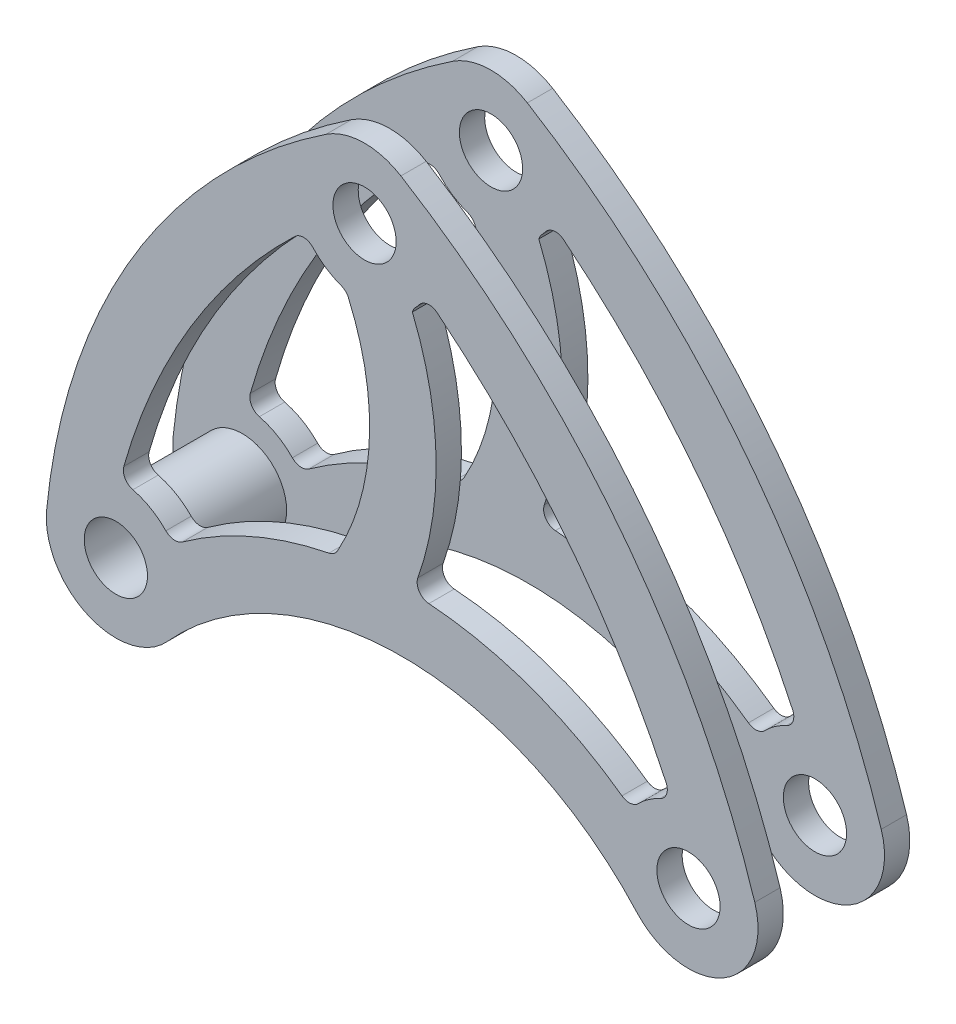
ISO-10303-21;
HEADER;
FILE_DESCRIPTION(('STEP AP214'),'2;1');
FILE_NAME('part.step','',(''),(''),'','','');
FILE_SCHEMA(('AUTOMOTIVE_DESIGN { 1 0 10303 214 1 1 1 1 }'));
ENDSEC;
DATA;
#1=APPLICATION_CONTEXT('core data for automotive mechanical design processes');
#2=APPLICATION_PROTOCOL_DEFINITION('international standard','automotive_design',2000,#1);
#3=PRODUCT_CONTEXT('',#1,'mechanical');
#4=PRODUCT('Part','Part','',(#3));
#5=PRODUCT_RELATED_PRODUCT_CATEGORY('part','',(#4));
#6=PRODUCT_DEFINITION_FORMATION('','',#4);
#7=PRODUCT_DEFINITION_CONTEXT('part definition',#1,'design');
#8=PRODUCT_DEFINITION('design','',#6,#7);
#9=PRODUCT_DEFINITION_SHAPE('','',#8);
#10=(LENGTH_UNIT() NAMED_UNIT(*) SI_UNIT(.MILLI.,.METRE.));
#11=(NAMED_UNIT(*) PLANE_ANGLE_UNIT() SI_UNIT($,.RADIAN.));
#12=(NAMED_UNIT(*) SI_UNIT($,.STERADIAN.) SOLID_ANGLE_UNIT());
#13=UNCERTAINTY_MEASURE_WITH_UNIT(LENGTH_MEASURE(1.E-05),#10,'distance_accuracy_value','');
#14=(GEOMETRIC_REPRESENTATION_CONTEXT(3) GLOBAL_UNCERTAINTY_ASSIGNED_CONTEXT((#13)) GLOBAL_UNIT_ASSIGNED_CONTEXT((#10,
#11,#12)) REPRESENTATION_CONTEXT('',''));
#15=CARTESIAN_POINT('',(0.,0.,0.));
#16=DIRECTION('',(0.,0.,1.));
#17=DIRECTION('',(1.,0.,0.));
#18=AXIS2_PLACEMENT_3D('',#15,#16,#17);
#19=CARTESIAN_POINT('',(-11.,76.4447234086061,20.));
#20=DIRECTION('',(0.,0.,1.));
#21=DIRECTION('',(0.,-1.,0.));
#22=AXIS2_PLACEMENT_3D('',#19,#20,#21);
#23=PLANE('',#22);
#24=CARTESIAN_POINT('',(34.9435943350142,53.2046486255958,20.));
#25=DIRECTION('',(0.,0.,1.));
#26=DIRECTION('',(0.,-1.,0.));
#27=AXIS2_PLACEMENT_3D('',#24,#25,#26);
#28=CIRCLE('',#27,2.);
#29=CARTESIAN_POINT('',(36.7759556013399,54.0061797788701,20.));
#30=VERTEX_POINT('',#29);
#31=CARTESIAN_POINT('',(35.6173732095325,55.0877370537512,20.));
#32=VERTEX_POINT('',#31);
#33=EDGE_CURVE('E338',#30,#32,#28,.T.);
#34=ORIENTED_EDGE('',*,*,#33,.T.);
#35=CARTESIAN_POINT('',(39.3231570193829,65.4447234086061,20.));
#36=DIRECTION('',(0.,0.,1.));
#37=DIRECTION('',(0.,-1.,0.));
#38=AXIS2_PLACEMENT_3D('',#35,#36,#37);
#39=CIRCLE('',#38,11.);
#40=CARTESIAN_POINT('',(31.172625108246,58.0576516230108,20.));
#41=VERTEX_POINT('',#40);
#42=EDGE_CURVE('E274',#41,#32,#39,.T.);
#43=ORIENTED_EDGE('',*,*,#42,.F.);
#44=CARTESIAN_POINT('',(29.6907102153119,56.7145476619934,20.));
#45=DIRECTION('',(0.,0.,1.));
#46=DIRECTION('',(0.,-1.,0.));
#47=AXIS2_PLACEMENT_3D('',#44,#45,#46);
#48=CIRCLE('',#47,2.);
#49=CARTESIAN_POINT('',(28.3069759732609,58.1585973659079,20.));
#50=VERTEX_POINT('',#49);
#51=EDGE_CURVE('E270',#50,#41,#48,.F.);
#52=ORIENTED_EDGE('',*,*,#51,.F.);
#53=CARTESIAN_POINT('',(97.4936880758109,-14.0438878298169,20.));
#54=DIRECTION('',(0.,0.,1.));
#55=DIRECTION('',(0.,-1.,0.));
#56=AXIS2_PLACEMENT_3D('',#53,#54,#55);
#57=CIRCLE('',#56,100.);
#58=CARTESIAN_POINT('',(1.26148371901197,13.147339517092,20.));
#59=VERTEX_POINT('',#58);
#60=EDGE_CURVE('E266',#59,#50,#57,.F.);
#61=ORIENTED_EDGE('',*,*,#60,.F.);
#62=CARTESIAN_POINT('',(3.18612780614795,12.6035149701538,20.));
#63=DIRECTION('',(0.,0.,1.));
#64=DIRECTION('',(0.,-1.,0.));
#65=AXIS2_PLACEMENT_3D('',#62,#63,#64);
#66=CIRCLE('',#65,2.);
#67=CARTESIAN_POINT('',(2.6959542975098,10.6645126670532,20.));
#68=VERTEX_POINT('',#67);
#69=EDGE_CURVE('E262',#68,#59,#66,.F.);
#70=ORIENTED_EDGE('',*,*,#69,.F.);
#71=CARTESIAN_POINT('',(0.,0.,20.));
#72=DIRECTION('',(0.,0.,1.));
#73=DIRECTION('',(0.,-1.,0.));
#74=AXIS2_PLACEMENT_3D('',#71,#72,#73);
#75=CIRCLE('',#74,11.);
#76=CARTESIAN_POINT('',(7.90944182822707,7.64465368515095,20.));
#77=VERTEX_POINT('',#76);
#78=EDGE_CURVE('E258',#77,#68,#75,.T.);
#79=ORIENTED_EDGE('',*,*,#78,.F.);
#80=CARTESIAN_POINT('',(9.34752216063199,9.03459071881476,20.));
#81=DIRECTION('',(0.,0.,1.));
#82=DIRECTION('',(0.,-1.,0.));
#83=AXIS2_PLACEMENT_3D('',#80,#81,#82);
#84=CIRCLE('',#83,2.);
#85=CARTESIAN_POINT('',(10.5158954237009,7.41135200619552,20.));
#86=VERTEX_POINT('',#85);
#87=EDGE_CURVE('E254',#86,#77,#84,.F.);
#88=ORIENTED_EDGE('',*,*,#87,.F.);
#89=CARTESIAN_POINT('',(45.275,-40.879999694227,20.));
#90=DIRECTION('',(0.,0.,1.));
#91=DIRECTION('',(0.,-1.,0.));
#92=AXIS2_PLACEMENT_3D('',#89,#90,#91);
#93=CIRCLE('',#92,59.5);
#94=CARTESIAN_POINT('',(33.6928197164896,17.4818294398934,20.));
#95=VERTEX_POINT('',#94);
#96=EDGE_CURVE('E44',#86,#95,#93,.F.);
#97=ORIENTED_EDGE('',*,*,#96,.T.);
#98=CARTESIAN_POINT('',(33.3035027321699,19.4435715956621,20.));
#99=DIRECTION('',(0.,0.,1.));
#100=DIRECTION('',(0.,-1.,0.));
#101=AXIS2_PLACEMENT_3D('',#98,#99,#100);
#102=CIRCLE('',#101,2.);
#103=CARTESIAN_POINT('',(35.0495433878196,18.4682039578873,20.));
#104=VERTEX_POINT('',#103);
#105=EDGE_CURVE('E246',#104,#95,#102,.F.);
#106=ORIENTED_EDGE('',*,*,#105,.F.);
#107=CARTESIAN_POINT('',(0.128730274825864,37.9755567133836,20.));
#108=DIRECTION('',(0.,0.,1.));
#109=DIRECTION('',(0.,-1.,0.));
#110=AXIS2_PLACEMENT_3D('',#107,#108,#109);
#111=CIRCLE('',#110,40.);
#112=EDGE_CURVE('E52',#30,#104,#111,.F.);
#113=ORIENTED_EDGE('',*,*,#112,.F.);
#114=EDGE_LOOP('',(#34,#43,#52,#61,#70,#79,#88,#97,#106,#113));
#115=FACE_BOUND('',#114,.T.);
#116=CARTESIAN_POINT('',(90.55,0.,20.));
#117=DIRECTION('',(0.,0.,1.));
#118=DIRECTION('',(0.,-1.,0.));
#119=AXIS2_PLACEMENT_3D('',#116,#117,#118);
#120=CIRCLE('',#119,11.);
#121=CARTESIAN_POINT('',(82.3856557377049,-7.37180322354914,20.));
#122=VERTEX_POINT('',#121);
#123=CARTESIAN_POINT('',(101.034303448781,3.32857044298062,20.));
#124=VERTEX_POINT('',#123);
#125=EDGE_CURVE('E370',#122,#124,#120,.T.);
#126=ORIENTED_EDGE('',*,*,#125,.F.);
#127=CARTESIAN_POINT('',(45.275,-40.879999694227,20.));
#128=DIRECTION('',(0.,0.,1.));
#129=DIRECTION('',(0.,-1.,0.));
#130=AXIS2_PLACEMENT_3D('',#127,#128,#129);
#131=CIRCLE('',#130,50.);
#132=CARTESIAN_POINT('',(8.16434426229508,-7.37180322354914,20.));
#133=VERTEX_POINT('',#132);
#134=EDGE_CURVE('E216',#133,#122,#131,.F.);
#135=ORIENTED_EDGE('',*,*,#134,.F.);
#136=CARTESIAN_POINT('',(0.,0.,20.));
#137=DIRECTION('',(0.,0.,1.));
#138=DIRECTION('',(0.,-1.,0.));
#139=AXIS2_PLACEMENT_3D('',#136,#137,#138);
#140=CIRCLE('',#139,11.);
#141=CARTESIAN_POINT('',(-10.9474983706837,1.07344279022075,20.));
#142=VERTEX_POINT('',#141);
#143=EDGE_CURVE('E207',#142,#133,#140,.T.);
#144=ORIENTED_EDGE('',*,*,#143,.F.);
#145=CARTESIAN_POINT('',(88.5752140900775,-8.68512802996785,20.));
#146=DIRECTION('',(0.,0.,1.));
#147=DIRECTION('',(0.,-1.,0.));
#148=AXIS2_PLACEMENT_3D('',#145,#146,#147);
#149=CIRCLE('',#148,100.);
#150=CARTESIAN_POINT('',(33.2358241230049,74.6068398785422,20.));
#151=VERTEX_POINT('',#150);
#152=EDGE_CURVE('E213',#151,#142,#149,.T.);
#153=ORIENTED_EDGE('',*,*,#152,.F.);
#154=CARTESIAN_POINT('',(39.3231570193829,65.4447234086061,20.));
#155=DIRECTION('',(0.,0.,1.));
#156=DIRECTION('',(0.,-1.,0.));
#157=AXIS2_PLACEMENT_3D('',#154,#155,#156);
#158=CIRCLE('',#157,11.);
#159=CARTESIAN_POINT('',(45.0722060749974,74.8228060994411,20.));
#160=VERTEX_POINT('',#159);
#161=EDGE_CURVE('E376',#160,#151,#158,.T.);
#162=ORIENTED_EDGE('',*,*,#161,.F.);
#163=CARTESIAN_POINT('',(-22.8711009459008,-36.0090802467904,20.));
#164=DIRECTION('',(0.,0.,1.));
#165=DIRECTION('',(0.,-1.,0.));
#166=AXIS2_PLACEMENT_3D('',#163,#164,#165);
#167=CIRCLE('',#166,130.);
#168=EDGE_CURVE('E350',#160,#124,#167,.F.);
#169=ORIENTED_EDGE('',*,*,#168,.T.);
#170=EDGE_LOOP('',(#126,#135,#144,#153,#162,#169));
#171=FACE_BOUND('',#170,.T.);
#172=CARTESIAN_POINT('',(0.128730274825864,37.9755567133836,20.));
#173=DIRECTION('',(0.,0.,1.));
#174=DIRECTION('',(0.,-1.,0.));
#175=AXIS2_PLACEMENT_3D('',#172,#173,#174);
#176=CIRCLE('',#175,50.5193131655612);
#177=CARTESIAN_POINT('',(46.8888032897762,57.0987513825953,20.));
#178=VERTEX_POINT('',#177);
#179=CARTESIAN_POINT('',(47.7572916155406,21.1315326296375,20.));
#180=VERTEX_POINT('',#179);
#181=EDGE_CURVE('E333',#178,#180,#176,.F.);
#182=ORIENTED_EDGE('',*,*,#181,.T.);
#183=CARTESIAN_POINT('',(49.6428501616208,20.4646975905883,20.));
#184=DIRECTION('',(0.,0.,1.));
#185=DIRECTION('',(0.,-1.,0.));
#186=AXIS2_PLACEMENT_3D('',#183,#184,#185);
#187=CIRCLE('',#186,2.);
#188=CARTESIAN_POINT('',(49.5008062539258,18.4697480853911,20.));
#189=VERTEX_POINT('',#188);
#190=EDGE_CURVE('E352',#180,#189,#187,.T.);
#191=ORIENTED_EDGE('',*,*,#190,.T.);
#192=CARTESIAN_POINT('',(45.275,-40.879999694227,20.));
#193=DIRECTION('',(0.,0.,1.));
#194=DIRECTION('',(0.,-1.,0.));
#195=AXIS2_PLACEMENT_3D('',#192,#193,#194);
#196=CIRCLE('',#195,59.5);
#197=CARTESIAN_POINT('',(80.0341045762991,7.41135200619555,20.));
#198=VERTEX_POINT('',#197);
#199=EDGE_CURVE('E367',#189,#198,#196,.F.);
#200=ORIENTED_EDGE('',*,*,#199,.T.);
#201=CARTESIAN_POINT('',(81.202477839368,9.0345907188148,20.));
#202=DIRECTION('',(0.,0.,1.));
#203=DIRECTION('',(0.,-1.,0.));
#204=AXIS2_PLACEMENT_3D('',#201,#202,#203);
#205=CIRCLE('',#204,2.);
#206=CARTESIAN_POINT('',(82.6405581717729,7.64465368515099,20.));
#207=VERTEX_POINT('',#206);
#208=EDGE_CURVE('E363',#198,#207,#205,.T.);
#209=ORIENTED_EDGE('',*,*,#208,.T.);
#210=CARTESIAN_POINT('',(90.55,0.,20.));
#211=DIRECTION('',(0.,0.,1.));
#212=DIRECTION('',(0.,-1.,0.));
#213=AXIS2_PLACEMENT_3D('',#210,#211,#212);
#214=CIRCLE('',#213,11.);
#215=CARTESIAN_POINT('',(86.0253089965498,10.02632391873,20.));
#216=VERTEX_POINT('',#215);
#217=EDGE_CURVE('E305',#216,#207,#214,.T.);
#218=ORIENTED_EDGE('',*,*,#217,.F.);
#219=CARTESIAN_POINT('',(85.2026379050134,11.8492919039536,20.));
#220=DIRECTION('',(0.,0.,1.));
#221=DIRECTION('',(0.,-1.,0.));
#222=AXIS2_PLACEMENT_3D('',#219,#220,#221);
#223=CIRCLE('',#222,2.);
#224=CARTESIAN_POINT('',(87.0153959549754,12.694222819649,20.));
#225=VERTEX_POINT('',#224);
#226=EDGE_CURVE('E361',#216,#225,#223,.T.);
#227=ORIENTED_EDGE('',*,*,#226,.T.);
#228=CARTESIAN_POINT('',(-30.8138772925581,-42.2262867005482,20.));
#229=DIRECTION('',(0.,0.,1.));
#230=DIRECTION('',(0.,-1.,0.));
#231=AXIS2_PLACEMENT_3D('',#228,#229,#230);
#232=CIRCLE('',#231,130.);
#233=CARTESIAN_POINT('',(50.7970022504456,58.9649398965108,20.));
#234=VERTEX_POINT('',#233);
#235=EDGE_CURVE('E297',#234,#225,#232,.F.);
#236=ORIENTED_EDGE('',*,*,#235,.F.);
#237=CARTESIAN_POINT('',(49.5414502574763,57.4081517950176,20.));
#238=DIRECTION('',(0.,0.,1.));
#239=DIRECTION('',(0.,-1.,0.));
#240=AXIS2_PLACEMENT_3D('',#237,#238,#239);
#241=CIRCLE('',#240,2.);
#242=CARTESIAN_POINT('',(47.9694051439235,58.6445474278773,20.));
#243=VERTEX_POINT('',#242);
#244=EDGE_CURVE('E293',#243,#234,#241,.F.);
#245=ORIENTED_EDGE('',*,*,#244,.F.);
#246=CARTESIAN_POINT('',(39.3231570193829,65.4447234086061,20.));
#247=DIRECTION('',(0.,0.,1.));
#248=DIRECTION('',(0.,-1.,0.));
#249=AXIS2_PLACEMENT_3D('',#246,#247,#248);
#250=CIRCLE('',#249,11.);
#251=CARTESIAN_POINT('',(47.355196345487,57.9289836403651,20.));
#252=VERTEX_POINT('',#251);
#253=EDGE_CURVE('E289',#252,#243,#250,.T.);
#254=ORIENTED_EDGE('',*,*,#253,.F.);
#255=CARTESIAN_POINT('',(48.8155671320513,56.562485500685,20.));
#256=DIRECTION('',(0.,0.,1.));
#257=DIRECTION('',(0.,-1.,0.));
#258=AXIS2_PLACEMENT_3D('',#255,#256,#257);
#259=CIRCLE('',#258,2.);
#260=EDGE_CURVE('E284',#178,#252,#259,.F.);
#261=ORIENTED_EDGE('',*,*,#260,.F.);
#262=EDGE_LOOP('',(#182,#191,#200,#209,#218,#227,#236,#245,#254,#261));
#263=FACE_BOUND('',#262,.T.);
#264=CARTESIAN_POINT('',(39.3231570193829,65.4447234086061,20.));
#265=DIRECTION('',(0.,0.,1.));
#266=DIRECTION('',(0.,-1.,0.));
#267=AXIS2_PLACEMENT_3D('',#264,#265,#266);
#268=CIRCLE('',#267,5.);
#269=CARTESIAN_POINT('',(39.3231570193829,60.4447234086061,20.));
#270=VERTEX_POINT('',#269);
#271=EDGE_CURVE('E330',#270,#270,#268,.T.);
#272=ORIENTED_EDGE('',*,*,#271,.T.);
#273=EDGE_LOOP('',(#272));
#274=FACE_BOUND('',#273,.T.);
#275=CARTESIAN_POINT('',(90.55,0.,20.));
#276=DIRECTION('',(0.,0.,1.));
#277=DIRECTION('',(0.,-1.,0.));
#278=AXIS2_PLACEMENT_3D('',#275,#276,#277);
#279=CIRCLE('',#278,5.);
#280=CARTESIAN_POINT('',(90.55,-5.,20.));
#281=VERTEX_POINT('',#280);
#282=EDGE_CURVE('E327',#281,#281,#279,.T.);
#283=ORIENTED_EDGE('',*,*,#282,.T.);
#284=EDGE_LOOP('',(#283));
#285=FACE_BOUND('',#284,.T.);
#286=CARTESIAN_POINT('',(0.,0.,20.));
#287=DIRECTION('',(0.,0.,1.));
#288=DIRECTION('',(0.,-1.,0.));
#289=AXIS2_PLACEMENT_3D('',#286,#287,#288);
#290=CIRCLE('',#289,7.);
#291=CARTESIAN_POINT('',(0.,-7.,20.));
#292=VERTEX_POINT('',#291);
#293=EDGE_CURVE('E11',#292,#292,#290,.F.);
#294=ORIENTED_EDGE('',*,*,#293,.F.);
#295=EDGE_LOOP('',(#294));
#296=FACE_BOUND('',#295,.T.);
#297=ADVANCED_FACE('F35',(#115,#171,#263,#274,#285,#296),#23,.F.);
#298=CARTESIAN_POINT('',(45.275,-40.879999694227,24.));
#299=DIRECTION('',(0.,0.,-1.));
#300=DIRECTION('',(-1.,0.,0.));
#301=AXIS2_PLACEMENT_3D('',#298,#299,#300);
#302=CYLINDRICAL_SURFACE('',#301,50.);
#303=DIRECTION('',(0.,0.,-1.));
#304=VECTOR('',#303,1.);
#305=CARTESIAN_POINT('',(8.16434426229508,-7.37180322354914,24.));
#306=LINE('',#305,#304);
#307=CARTESIAN_POINT('',(8.16434426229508,-7.37180322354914,24.));
#308=VERTEX_POINT('',#307);
#309=EDGE_CURVE('E240',#308,#133,#306,.T.);
#310=ORIENTED_EDGE('',*,*,#309,.T.);
#311=ORIENTED_EDGE('',*,*,#134,.T.);
#312=DIRECTION('',(0.,0.,-1.));
#313=VECTOR('',#312,1.);
#314=CARTESIAN_POINT('',(82.3856557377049,-7.37180322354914,24.));
#315=LINE('',#314,#313);
#316=CARTESIAN_POINT('',(82.3856557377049,-7.37180322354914,24.));
#317=VERTEX_POINT('',#316);
#318=EDGE_CURVE('E372',#317,#122,#315,.T.);
#319=ORIENTED_EDGE('',*,*,#318,.F.);
#320=CARTESIAN_POINT('',(45.275,-40.879999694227,24.));
#321=DIRECTION('',(0.,0.,1.));
#322=DIRECTION('',(1.,0.,0.));
#323=AXIS2_PLACEMENT_3D('',#320,#321,#322);
#324=CIRCLE('',#323,50.);
#325=EDGE_CURVE('E403',#308,#317,#324,.F.);
#326=ORIENTED_EDGE('',*,*,#325,.F.);
#327=EDGE_LOOP('',(#310,#311,#319,#326));
#328=FACE_BOUND('',#327,.T.);
#329=ADVANCED_FACE('F37',(#328),#302,.F.);
#330=CARTESIAN_POINT('',(90.55,0.,24.));
#331=DIRECTION('',(0.,0.,-1.));
#332=DIRECTION('',(-1.,0.,0.));
#333=AXIS2_PLACEMENT_3D('',#330,#331,#332);
#334=CYLINDRICAL_SURFACE('',#333,11.);
#335=ORIENTED_EDGE('',*,*,#125,.T.);
#336=DIRECTION('',(0.,0.,-1.));
#337=VECTOR('',#336,1.);
#338=CARTESIAN_POINT('',(101.034303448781,3.32857044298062,24.));
#339=LINE('',#338,#337);
#340=CARTESIAN_POINT('',(101.034303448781,3.32857044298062,24.));
#341=VERTEX_POINT('',#340);
#342=EDGE_CURVE('E378',#341,#124,#339,.T.);
#343=ORIENTED_EDGE('',*,*,#342,.F.);
#344=CARTESIAN_POINT('',(90.55,0.,24.));
#345=DIRECTION('',(0.,0.,1.));
#346=DIRECTION('',(1.,0.,0.));
#347=AXIS2_PLACEMENT_3D('',#344,#345,#346);
#348=CIRCLE('',#347,11.);
#349=EDGE_CURVE('E400',#317,#341,#348,.T.);
#350=ORIENTED_EDGE('',*,*,#349,.F.);
#351=ORIENTED_EDGE('',*,*,#318,.T.);
#352=EDGE_LOOP('',(#335,#343,#350,#351));
#353=FACE_BOUND('',#352,.T.);
#354=ADVANCED_FACE('F399',(#353),#334,.T.);
#355=CARTESIAN_POINT('',(-22.8711009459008,-36.0090802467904,24.));
#356=DIRECTION('',(0.,0.,-1.));
#357=DIRECTION('',(-1.,0.,0.));
#358=AXIS2_PLACEMENT_3D('',#355,#356,#357);
#359=CYLINDRICAL_SURFACE('',#358,130.);
#360=ORIENTED_EDGE('',*,*,#168,.F.);
#361=DIRECTION('',(0.,0.,-1.));
#362=VECTOR('',#361,1.);
#363=CARTESIAN_POINT('',(45.0722060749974,74.8228060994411,24.));
#364=LINE('',#363,#362);
#365=CARTESIAN_POINT('',(45.0722060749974,74.8228060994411,24.));
#366=VERTEX_POINT('',#365);
#367=EDGE_CURVE('E377',#366,#160,#364,.T.);
#368=ORIENTED_EDGE('',*,*,#367,.F.);
#369=CARTESIAN_POINT('',(-22.8711009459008,-36.0090802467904,24.));
#370=DIRECTION('',(0.,0.,1.));
#371=DIRECTION('',(1.,0.,0.));
#372=AXIS2_PLACEMENT_3D('',#369,#370,#371);
#373=CIRCLE('',#372,130.);
#374=EDGE_CURVE('E382',#366,#341,#373,.F.);
#375=ORIENTED_EDGE('',*,*,#374,.T.);
#376=ORIENTED_EDGE('',*,*,#342,.T.);
#377=EDGE_LOOP('',(#360,#368,#375,#376));
#378=FACE_BOUND('',#377,.T.);
#379=ADVANCED_FACE('F393',(#378),#359,.T.);
#380=CARTESIAN_POINT('',(39.3231570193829,65.4447234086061,24.));
#381=DIRECTION('',(0.,0.,-1.));
#382=DIRECTION('',(-1.,0.,0.));
#383=AXIS2_PLACEMENT_3D('',#380,#381,#382);
#384=CYLINDRICAL_SURFACE('',#383,11.);
#385=ORIENTED_EDGE('',*,*,#161,.T.);
#386=DIRECTION('',(0.,0.,-1.));
#387=VECTOR('',#386,1.);
#388=CARTESIAN_POINT('',(33.2358241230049,74.6068398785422,24.));
#389=LINE('',#388,#387);
#390=CARTESIAN_POINT('',(33.2358241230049,74.6068398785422,24.));
#391=VERTEX_POINT('',#390);
#392=EDGE_CURVE('E227',#391,#151,#389,.T.);
#393=ORIENTED_EDGE('',*,*,#392,.F.);
#394=CARTESIAN_POINT('',(39.3231570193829,65.4447234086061,24.));
#395=DIRECTION('',(0.,0.,1.));
#396=DIRECTION('',(1.,0.,0.));
#397=AXIS2_PLACEMENT_3D('',#394,#395,#396);
#398=CIRCLE('',#397,11.);
#399=EDGE_CURVE('E388',#366,#391,#398,.T.);
#400=ORIENTED_EDGE('',*,*,#399,.F.);
#401=ORIENTED_EDGE('',*,*,#367,.T.);
#402=EDGE_LOOP('',(#385,#393,#400,#401));
#403=FACE_BOUND('',#402,.T.);
#404=ADVANCED_FACE('F387',(#403),#384,.T.);
#405=CARTESIAN_POINT('',(88.5752140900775,-8.68512802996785,24.));
#406=DIRECTION('',(0.,0.,-1.));
#407=DIRECTION('',(-1.,0.,0.));
#408=AXIS2_PLACEMENT_3D('',#405,#406,#407);
#409=CYLINDRICAL_SURFACE('',#408,100.);
#410=ORIENTED_EDGE('',*,*,#392,.T.);
#411=ORIENTED_EDGE('',*,*,#152,.T.);
#412=DIRECTION('',(0.,0.,-1.));
#413=VECTOR('',#412,1.);
#414=CARTESIAN_POINT('',(-10.9474983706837,1.07344279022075,24.));
#415=LINE('',#414,#413);
#416=CARTESIAN_POINT('',(-10.9474983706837,1.07344279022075,24.));
#417=VERTEX_POINT('',#416);
#418=EDGE_CURVE('E219',#417,#142,#415,.T.);
#419=ORIENTED_EDGE('',*,*,#418,.F.);
#420=CARTESIAN_POINT('',(88.5752140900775,-8.68512802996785,24.));
#421=DIRECTION('',(0.,0.,1.));
#422=DIRECTION('',(1.,0.,0.));
#423=AXIS2_PLACEMENT_3D('',#420,#421,#422);
#424=CIRCLE('',#423,100.);
#425=EDGE_CURVE('E1182',#391,#417,#424,.T.);
#426=ORIENTED_EDGE('',*,*,#425,.F.);
#427=EDGE_LOOP('',(#410,#411,#419,#426));
#428=FACE_BOUND('',#427,.T.);
#429=ADVANCED_FACE('F223',(#428),#409,.T.);
#430=CARTESIAN_POINT('',(0.128730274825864,37.9755567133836,24.));
#431=DIRECTION('',(0.,0.,-1.));
#432=DIRECTION('',(-1.,0.,0.));
#433=AXIS2_PLACEMENT_3D('',#430,#431,#432);
#434=CYLINDRICAL_SURFACE('',#433,40.);
#435=DIRECTION('',(0.,0.,-1.));
#436=VECTOR('',#435,1.);
#437=CARTESIAN_POINT('',(36.7759556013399,54.0061797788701,24.));
#438=LINE('',#437,#436);
#439=CARTESIAN_POINT('',(36.7759556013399,54.0061797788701,24.));
#440=VERTEX_POINT('',#439);
#441=EDGE_CURVE('E228',#440,#30,#438,.T.);
#442=ORIENTED_EDGE('',*,*,#441,.T.);
#443=ORIENTED_EDGE('',*,*,#112,.T.);
#444=DIRECTION('',(0.,0.,-1.));
#445=VECTOR('',#444,1.);
#446=CARTESIAN_POINT('',(35.0495433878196,18.4682039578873,24.));
#447=LINE('',#446,#445);
#448=CARTESIAN_POINT('',(35.0495433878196,18.4682039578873,24.));
#449=VERTEX_POINT('',#448);
#450=EDGE_CURVE('E243',#449,#104,#447,.T.);
#451=ORIENTED_EDGE('',*,*,#450,.F.);
#452=CARTESIAN_POINT('',(0.128730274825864,37.9755567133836,24.));
#453=DIRECTION('',(0.,0.,1.));
#454=DIRECTION('',(1.,0.,0.));
#455=AXIS2_PLACEMENT_3D('',#452,#453,#454);
#456=CIRCLE('',#455,40.);
#457=EDGE_CURVE('E435',#440,#449,#456,.F.);
#458=ORIENTED_EDGE('',*,*,#457,.F.);
#459=EDGE_LOOP('',(#442,#443,#451,#458));
#460=FACE_BOUND('',#459,.T.);
#461=ADVANCED_FACE('F552',(#460),#434,.F.);
#462=CARTESIAN_POINT('',(33.3035027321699,19.4435715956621,24.));
#463=DIRECTION('',(0.,0.,-1.));
#464=DIRECTION('',(-1.,0.,0.));
#465=AXIS2_PLACEMENT_3D('',#462,#463,#464);
#466=CYLINDRICAL_SURFACE('',#465,2.);
#467=ORIENTED_EDGE('',*,*,#450,.T.);
#468=ORIENTED_EDGE('',*,*,#105,.T.);
#469=DIRECTION('',(0.,0.,-1.));
#470=VECTOR('',#469,1.);
#471=CARTESIAN_POINT('',(33.6928197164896,17.4818294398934,24.));
#472=LINE('',#471,#470);
#473=CARTESIAN_POINT('',(33.6928197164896,17.4818294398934,24.));
#474=VERTEX_POINT('',#473);
#475=EDGE_CURVE('E247',#474,#95,#472,.T.);
#476=ORIENTED_EDGE('',*,*,#475,.F.);
#477=CARTESIAN_POINT('',(33.3035027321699,19.4435715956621,24.));
#478=DIRECTION('',(0.,0.,1.));
#479=DIRECTION('',(1.,0.,0.));
#480=AXIS2_PLACEMENT_3D('',#477,#478,#479);
#481=CIRCLE('',#480,2.);
#482=EDGE_CURVE('E431',#449,#474,#481,.F.);
#483=ORIENTED_EDGE('',*,*,#482,.F.);
#484=EDGE_LOOP('',(#467,#468,#476,#483));
#485=FACE_BOUND('',#484,.T.);
#486=ADVANCED_FACE('F548',(#485),#466,.F.);
#487=CARTESIAN_POINT('',(45.275,-40.879999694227,24.));
#488=DIRECTION('',(0.,0.,-1.));
#489=DIRECTION('',(-1.,0.,0.));
#490=AXIS2_PLACEMENT_3D('',#487,#488,#489);
#491=CYLINDRICAL_SURFACE('',#490,59.5);
#492=ORIENTED_EDGE('',*,*,#96,.F.);
#493=DIRECTION('',(0.,0.,-1.));
#494=VECTOR('',#493,1.);
#495=CARTESIAN_POINT('',(10.5158954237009,7.41135200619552,24.));
#496=LINE('',#495,#494);
#497=CARTESIAN_POINT('',(10.5158954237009,7.41135200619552,24.));
#498=VERTEX_POINT('',#497);
#499=EDGE_CURVE('E250',#498,#86,#496,.T.);
#500=ORIENTED_EDGE('',*,*,#499,.F.);
#501=CARTESIAN_POINT('',(45.275,-40.879999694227,24.));
#502=DIRECTION('',(0.,0.,1.));
#503=DIRECTION('',(1.,0.,0.));
#504=AXIS2_PLACEMENT_3D('',#501,#502,#503);
#505=CIRCLE('',#504,59.5);
#506=EDGE_CURVE('E251',#498,#474,#505,.F.);
#507=ORIENTED_EDGE('',*,*,#506,.T.);
#508=ORIENTED_EDGE('',*,*,#475,.T.);
#509=EDGE_LOOP('',(#492,#500,#507,#508));
#510=FACE_BOUND('',#509,.T.);
#511=ADVANCED_FACE('F544',(#510),#491,.T.);
#512=CARTESIAN_POINT('',(9.34752216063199,9.03459071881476,24.));
#513=DIRECTION('',(0.,0.,-1.));
#514=DIRECTION('',(-1.,0.,0.));
#515=AXIS2_PLACEMENT_3D('',#512,#513,#514);
#516=CYLINDRICAL_SURFACE('',#515,2.);
#517=ORIENTED_EDGE('',*,*,#499,.T.);
#518=ORIENTED_EDGE('',*,*,#87,.T.);
#519=DIRECTION('',(0.,0.,-1.));
#520=VECTOR('',#519,1.);
#521=CARTESIAN_POINT('',(7.90944182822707,7.64465368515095,24.));
#522=LINE('',#521,#520);
#523=CARTESIAN_POINT('',(7.90944182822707,7.64465368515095,24.));
#524=VERTEX_POINT('',#523);
#525=EDGE_CURVE('E255',#524,#77,#522,.T.);
#526=ORIENTED_EDGE('',*,*,#525,.F.);
#527=CARTESIAN_POINT('',(9.34752216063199,9.03459071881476,24.));
#528=DIRECTION('',(0.,0.,1.));
#529=DIRECTION('',(1.,0.,0.));
#530=AXIS2_PLACEMENT_3D('',#527,#528,#529);
#531=CIRCLE('',#530,2.);
#532=EDGE_CURVE('E429',#498,#524,#531,.F.);
#533=ORIENTED_EDGE('',*,*,#532,.F.);
#534=EDGE_LOOP('',(#517,#518,#526,#533));
#535=FACE_BOUND('',#534,.T.);
#536=ADVANCED_FACE('F540',(#535),#516,.F.);
#537=CARTESIAN_POINT('',(0.,0.,24.));
#538=DIRECTION('',(0.,0.,-1.));
#539=DIRECTION('',(-1.,0.,0.));
#540=AXIS2_PLACEMENT_3D('',#537,#538,#539);
#541=CYLINDRICAL_SURFACE('',#540,11.);
#542=ORIENTED_EDGE('',*,*,#525,.T.);
#543=ORIENTED_EDGE('',*,*,#78,.T.);
#544=DIRECTION('',(0.,0.,-1.));
#545=VECTOR('',#544,1.);
#546=CARTESIAN_POINT('',(2.6959542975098,10.6645126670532,24.));
#547=LINE('',#546,#545);
#548=CARTESIAN_POINT('',(2.6959542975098,10.6645126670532,24.));
#549=VERTEX_POINT('',#548);
#550=EDGE_CURVE('E259',#549,#68,#547,.T.);
#551=ORIENTED_EDGE('',*,*,#550,.F.);
#552=CARTESIAN_POINT('',(0.,0.,24.));
#553=DIRECTION('',(0.,0.,1.));
#554=DIRECTION('',(1.,0.,0.));
#555=AXIS2_PLACEMENT_3D('',#552,#553,#554);
#556=CIRCLE('',#555,11.);
#557=EDGE_CURVE('E427',#524,#549,#556,.T.);
#558=ORIENTED_EDGE('',*,*,#557,.F.);
#559=EDGE_LOOP('',(#542,#543,#551,#558));
#560=FACE_BOUND('',#559,.T.);
#561=ADVANCED_FACE('F536',(#560),#541,.T.);
#562=CARTESIAN_POINT('',(3.18612780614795,12.6035149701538,24.));
#563=DIRECTION('',(0.,0.,-1.));
#564=DIRECTION('',(-1.,0.,0.));
#565=AXIS2_PLACEMENT_3D('',#562,#563,#564);
#566=CYLINDRICAL_SURFACE('',#565,2.);
#567=ORIENTED_EDGE('',*,*,#550,.T.);
#568=ORIENTED_EDGE('',*,*,#69,.T.);
#569=DIRECTION('',(0.,0.,-1.));
#570=VECTOR('',#569,1.);
#571=CARTESIAN_POINT('',(1.26148371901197,13.147339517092,24.));
#572=LINE('',#571,#570);
#573=CARTESIAN_POINT('',(1.26148371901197,13.147339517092,24.));
#574=VERTEX_POINT('',#573);
#575=EDGE_CURVE('E263',#574,#59,#572,.T.);
#576=ORIENTED_EDGE('',*,*,#575,.F.);
#577=CARTESIAN_POINT('',(3.18612780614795,12.6035149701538,24.));
#578=DIRECTION('',(0.,0.,1.));
#579=DIRECTION('',(1.,0.,0.));
#580=AXIS2_PLACEMENT_3D('',#577,#578,#579);
#581=CIRCLE('',#580,2.);
#582=EDGE_CURVE('E425',#549,#574,#581,.F.);
#583=ORIENTED_EDGE('',*,*,#582,.F.);
#584=EDGE_LOOP('',(#567,#568,#576,#583));
#585=FACE_BOUND('',#584,.T.);
#586=ADVANCED_FACE('F532',(#585),#566,.F.);
#587=CARTESIAN_POINT('',(97.4936880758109,-14.0438878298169,24.));
#588=DIRECTION('',(0.,0.,-1.));
#589=DIRECTION('',(-1.,0.,0.));
#590=AXIS2_PLACEMENT_3D('',#587,#588,#589);
#591=CYLINDRICAL_SURFACE('',#590,100.);
#592=ORIENTED_EDGE('',*,*,#575,.T.);
#593=ORIENTED_EDGE('',*,*,#60,.T.);
#594=DIRECTION('',(0.,0.,-1.));
#595=VECTOR('',#594,1.);
#596=CARTESIAN_POINT('',(28.3069759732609,58.1585973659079,24.));
#597=LINE('',#596,#595);
#598=CARTESIAN_POINT('',(28.3069759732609,58.1585973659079,24.));
#599=VERTEX_POINT('',#598);
#600=EDGE_CURVE('E267',#599,#50,#597,.T.);
#601=ORIENTED_EDGE('',*,*,#600,.F.);
#602=CARTESIAN_POINT('',(97.4936880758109,-14.0438878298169,24.));
#603=DIRECTION('',(0.,0.,1.));
#604=DIRECTION('',(1.,0.,0.));
#605=AXIS2_PLACEMENT_3D('',#602,#603,#604);
#606=CIRCLE('',#605,100.);
#607=EDGE_CURVE('E423',#574,#599,#606,.F.);
#608=ORIENTED_EDGE('',*,*,#607,.F.);
#609=EDGE_LOOP('',(#592,#593,#601,#608));
#610=FACE_BOUND('',#609,.T.);
#611=ADVANCED_FACE('F528',(#610),#591,.F.);
#612=CARTESIAN_POINT('',(29.6907102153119,56.7145476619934,24.));
#613=DIRECTION('',(0.,0.,-1.));
#614=DIRECTION('',(-1.,0.,0.));
#615=AXIS2_PLACEMENT_3D('',#612,#613,#614);
#616=CYLINDRICAL_SURFACE('',#615,2.);
#617=ORIENTED_EDGE('',*,*,#600,.T.);
#618=ORIENTED_EDGE('',*,*,#51,.T.);
#619=DIRECTION('',(0.,0.,-1.));
#620=VECTOR('',#619,1.);
#621=CARTESIAN_POINT('',(31.1726251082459,58.0576516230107,24.));
#622=LINE('',#621,#620);
#623=CARTESIAN_POINT('',(31.1726251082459,58.0576516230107,24.));
#624=VERTEX_POINT('',#623);
#625=EDGE_CURVE('E271',#624,#41,#622,.T.);
#626=ORIENTED_EDGE('',*,*,#625,.F.);
#627=CARTESIAN_POINT('',(29.6907102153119,56.7145476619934,24.));
#628=DIRECTION('',(0.,0.,1.));
#629=DIRECTION('',(1.,0.,0.));
#630=AXIS2_PLACEMENT_3D('',#627,#628,#629);
#631=CIRCLE('',#630,2.);
#632=EDGE_CURVE('E408',#599,#624,#631,.F.);
#633=ORIENTED_EDGE('',*,*,#632,.F.);
#634=EDGE_LOOP('',(#617,#618,#626,#633));
#635=FACE_BOUND('',#634,.T.);
#636=ADVANCED_FACE('F498',(#635),#616,.F.);
#637=CARTESIAN_POINT('',(39.3231570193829,65.4447234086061,24.));
#638=DIRECTION('',(0.,0.,-1.));
#639=DIRECTION('',(-1.,0.,0.));
#640=AXIS2_PLACEMENT_3D('',#637,#638,#639);
#641=CYLINDRICAL_SURFACE('',#640,11.);
#642=ORIENTED_EDGE('',*,*,#625,.T.);
#643=ORIENTED_EDGE('',*,*,#42,.T.);
#644=DIRECTION('',(0.,0.,-1.));
#645=VECTOR('',#644,1.);
#646=CARTESIAN_POINT('',(35.6173732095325,55.0877370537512,24.));
#647=LINE('',#646,#645);
#648=CARTESIAN_POINT('',(35.6173732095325,55.0877370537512,24.));
#649=VERTEX_POINT('',#648);
#650=EDGE_CURVE('E275',#649,#32,#647,.T.);
#651=ORIENTED_EDGE('',*,*,#650,.F.);
#652=CARTESIAN_POINT('',(39.3231570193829,65.4447234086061,24.));
#653=DIRECTION('',(0.,0.,1.));
#654=DIRECTION('',(1.,0.,0.));
#655=AXIS2_PLACEMENT_3D('',#652,#653,#654);
#656=CIRCLE('',#655,11.);
#657=EDGE_CURVE('E406',#624,#649,#656,.T.);
#658=ORIENTED_EDGE('',*,*,#657,.F.);
#659=EDGE_LOOP('',(#642,#643,#651,#658));
#660=FACE_BOUND('',#659,.T.);
#661=ADVANCED_FACE('F491',(#660),#641,.T.);
#662=CARTESIAN_POINT('',(0.128730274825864,37.9755567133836,24.));
#663=DIRECTION('',(0.,0.,-1.));
#664=DIRECTION('',(-1.,0.,0.));
#665=AXIS2_PLACEMENT_3D('',#662,#663,#664);
#666=CYLINDRICAL_SURFACE('',#665,50.5193131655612);
#667=ORIENTED_EDGE('',*,*,#181,.F.);
#668=DIRECTION('',(0.,0.,-1.));
#669=VECTOR('',#668,1.);
#670=CARTESIAN_POINT('',(46.888803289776,57.0987513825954,24.));
#671=LINE('',#670,#669);
#672=CARTESIAN_POINT('',(46.888803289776,57.0987513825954,24.));
#673=VERTEX_POINT('',#672);
#674=EDGE_CURVE('E281',#673,#178,#671,.T.);
#675=ORIENTED_EDGE('',*,*,#674,.F.);
#676=CARTESIAN_POINT('',(0.128730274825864,37.9755567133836,24.));
#677=DIRECTION('',(0.,0.,1.));
#678=DIRECTION('',(1.,0.,0.));
#679=AXIS2_PLACEMENT_3D('',#676,#677,#678);
#680=CIRCLE('',#679,50.5193131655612);
#681=CARTESIAN_POINT('',(47.7572916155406,21.1315326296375,24.));
#682=VERTEX_POINT('',#681);
#683=EDGE_CURVE('E315',#673,#682,#680,.F.);
#684=ORIENTED_EDGE('',*,*,#683,.T.);
#685=DIRECTION('',(0.,0.,-1.));
#686=VECTOR('',#685,1.);
#687=CARTESIAN_POINT('',(47.7572916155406,21.1315326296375,24.));
#688=LINE('',#687,#686);
#689=EDGE_CURVE('E285',#682,#180,#688,.T.);
#690=ORIENTED_EDGE('',*,*,#689,.T.);
#691=EDGE_LOOP('',(#667,#675,#684,#690));
#692=FACE_BOUND('',#691,.T.);
#693=ADVANCED_FACE('F489',(#692),#666,.T.);
#694=CARTESIAN_POINT('',(48.8155671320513,56.562485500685,24.));
#695=DIRECTION('',(0.,0.,-1.));
#696=DIRECTION('',(-1.,0.,0.));
#697=AXIS2_PLACEMENT_3D('',#694,#695,#696);
#698=CYLINDRICAL_SURFACE('',#697,2.);
#699=ORIENTED_EDGE('',*,*,#674,.T.);
#700=ORIENTED_EDGE('',*,*,#260,.T.);
#701=DIRECTION('',(0.,0.,-1.));
#702=VECTOR('',#701,1.);
#703=CARTESIAN_POINT('',(47.355196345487,57.9289836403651,24.));
#704=LINE('',#703,#702);
#705=CARTESIAN_POINT('',(47.355196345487,57.9289836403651,24.));
#706=VERTEX_POINT('',#705);
#707=EDGE_CURVE('E286',#706,#252,#704,.T.);
#708=ORIENTED_EDGE('',*,*,#707,.F.);
#709=CARTESIAN_POINT('',(48.8155671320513,56.562485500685,24.));
#710=DIRECTION('',(0.,0.,1.));
#711=DIRECTION('',(1.,0.,0.));
#712=AXIS2_PLACEMENT_3D('',#709,#710,#711);
#713=CIRCLE('',#712,2.);
#714=EDGE_CURVE('E218',#673,#706,#713,.F.);
#715=ORIENTED_EDGE('',*,*,#714,.F.);
#716=EDGE_LOOP('',(#699,#700,#708,#715));
#717=FACE_BOUND('',#716,.T.);
#718=ADVANCED_FACE('F459',(#717),#698,.F.);
#719=CARTESIAN_POINT('',(39.3231570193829,65.4447234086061,24.));
#720=DIRECTION('',(0.,0.,-1.));
#721=DIRECTION('',(-1.,0.,0.));
#722=AXIS2_PLACEMENT_3D('',#719,#720,#721);
#723=CYLINDRICAL_SURFACE('',#722,11.);
#724=ORIENTED_EDGE('',*,*,#707,.T.);
#725=ORIENTED_EDGE('',*,*,#253,.T.);
#726=DIRECTION('',(0.,0.,-1.));
#727=VECTOR('',#726,1.);
#728=CARTESIAN_POINT('',(47.9694051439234,58.6445474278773,24.));
#729=LINE('',#728,#727);
#730=CARTESIAN_POINT('',(47.9694051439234,58.6445474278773,24.));
#731=VERTEX_POINT('',#730);
#732=EDGE_CURVE('E290',#731,#243,#729,.T.);
#733=ORIENTED_EDGE('',*,*,#732,.F.);
#734=CARTESIAN_POINT('',(39.3231570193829,65.4447234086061,24.));
#735=DIRECTION('',(0.,0.,1.));
#736=DIRECTION('',(1.,0.,0.));
#737=AXIS2_PLACEMENT_3D('',#734,#735,#736);
#738=CIRCLE('',#737,11.);
#739=EDGE_CURVE('E451',#706,#731,#738,.T.);
#740=ORIENTED_EDGE('',*,*,#739,.F.);
#741=EDGE_LOOP('',(#724,#725,#733,#740));
#742=FACE_BOUND('',#741,.T.);
#743=ADVANCED_FACE('F461',(#742),#723,.T.);
#744=CARTESIAN_POINT('',(49.5414502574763,57.4081517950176,24.));
#745=DIRECTION('',(0.,0.,-1.));
#746=DIRECTION('',(-1.,0.,0.));
#747=AXIS2_PLACEMENT_3D('',#744,#745,#746);
#748=CYLINDRICAL_SURFACE('',#747,2.);
#749=ORIENTED_EDGE('',*,*,#732,.T.);
#750=ORIENTED_EDGE('',*,*,#244,.T.);
#751=DIRECTION('',(0.,0.,-1.));
#752=VECTOR('',#751,1.);
#753=CARTESIAN_POINT('',(50.7970022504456,58.9649398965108,24.));
#754=LINE('',#753,#752);
#755=CARTESIAN_POINT('',(50.7970022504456,58.9649398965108,24.));
#756=VERTEX_POINT('',#755);
#757=EDGE_CURVE('E294',#756,#234,#754,.T.);
#758=ORIENTED_EDGE('',*,*,#757,.F.);
#759=CARTESIAN_POINT('',(49.5414502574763,57.4081517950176,24.));
#760=DIRECTION('',(0.,0.,1.));
#761=DIRECTION('',(1.,0.,0.));
#762=AXIS2_PLACEMENT_3D('',#759,#760,#761);
#763=CIRCLE('',#762,2.);
#764=EDGE_CURVE('E450',#731,#756,#763,.F.);
#765=ORIENTED_EDGE('',*,*,#764,.F.);
#766=EDGE_LOOP('',(#749,#750,#758,#765));
#767=FACE_BOUND('',#766,.T.);
#768=ADVANCED_FACE('F465',(#767),#748,.F.);
#769=CARTESIAN_POINT('',(-30.8138772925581,-42.2262867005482,24.));
#770=DIRECTION('',(0.,0.,-1.));
#771=DIRECTION('',(-1.,0.,0.));
#772=AXIS2_PLACEMENT_3D('',#769,#770,#771);
#773=CYLINDRICAL_SURFACE('',#772,130.);
#774=ORIENTED_EDGE('',*,*,#757,.T.);
#775=ORIENTED_EDGE('',*,*,#235,.T.);
#776=DIRECTION('',(0.,0.,-1.));
#777=VECTOR('',#776,1.);
#778=CARTESIAN_POINT('',(87.0153959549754,12.694222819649,24.));
#779=LINE('',#778,#777);
#780=CARTESIAN_POINT('',(87.0153959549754,12.694222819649,24.));
#781=VERTEX_POINT('',#780);
#782=EDGE_CURVE('E298',#781,#225,#779,.T.);
#783=ORIENTED_EDGE('',*,*,#782,.F.);
#784=CARTESIAN_POINT('',(-30.8138772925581,-42.2262867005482,24.));
#785=DIRECTION('',(0.,0.,1.));
#786=DIRECTION('',(1.,0.,0.));
#787=AXIS2_PLACEMENT_3D('',#784,#785,#786);
#788=CIRCLE('',#787,130.);
#789=EDGE_CURVE('E446',#756,#781,#788,.F.);
#790=ORIENTED_EDGE('',*,*,#789,.F.);
#791=EDGE_LOOP('',(#774,#775,#783,#790));
#792=FACE_BOUND('',#791,.T.);
#793=ADVANCED_FACE('F470',(#792),#773,.F.);
#794=CARTESIAN_POINT('',(85.2026379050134,11.8492919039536,24.));
#795=DIRECTION('',(0.,0.,-1.));
#796=DIRECTION('',(-1.,0.,0.));
#797=AXIS2_PLACEMENT_3D('',#794,#795,#796);
#798=CYLINDRICAL_SURFACE('',#797,2.);
#799=ORIENTED_EDGE('',*,*,#226,.F.);
#800=DIRECTION('',(0.,0.,-1.));
#801=VECTOR('',#800,1.);
#802=CARTESIAN_POINT('',(86.0253089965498,10.02632391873,24.));
#803=LINE('',#802,#801);
#804=CARTESIAN_POINT('',(86.0253089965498,10.02632391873,24.));
#805=VERTEX_POINT('',#804);
#806=EDGE_CURVE('E301',#805,#216,#803,.T.);
#807=ORIENTED_EDGE('',*,*,#806,.F.);
#808=CARTESIAN_POINT('',(85.2026379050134,11.8492919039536,24.));
#809=DIRECTION('',(0.,0.,1.));
#810=DIRECTION('',(1.,0.,0.));
#811=AXIS2_PLACEMENT_3D('',#808,#809,#810);
#812=CIRCLE('',#811,2.);
#813=EDGE_CURVE('E302',#805,#781,#812,.T.);
#814=ORIENTED_EDGE('',*,*,#813,.T.);
#815=ORIENTED_EDGE('',*,*,#782,.T.);
#816=EDGE_LOOP('',(#799,#807,#814,#815));
#817=FACE_BOUND('',#816,.T.);
#818=ADVANCED_FACE('F473',(#817),#798,.F.);
#819=CARTESIAN_POINT('',(90.55,0.,24.));
#820=DIRECTION('',(0.,0.,-1.));
#821=DIRECTION('',(-1.,0.,0.));
#822=AXIS2_PLACEMENT_3D('',#819,#820,#821);
#823=CYLINDRICAL_SURFACE('',#822,11.);
#824=ORIENTED_EDGE('',*,*,#806,.T.);
#825=ORIENTED_EDGE('',*,*,#217,.T.);
#826=DIRECTION('',(0.,0.,-1.));
#827=VECTOR('',#826,1.);
#828=CARTESIAN_POINT('',(82.6405581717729,7.64465368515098,24.));
#829=LINE('',#828,#827);
#830=CARTESIAN_POINT('',(82.6405581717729,7.64465368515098,24.));
#831=VERTEX_POINT('',#830);
#832=EDGE_CURVE('E306',#831,#207,#829,.T.);
#833=ORIENTED_EDGE('',*,*,#832,.F.);
#834=CARTESIAN_POINT('',(90.55,0.,24.));
#835=DIRECTION('',(0.,0.,1.));
#836=DIRECTION('',(1.,0.,0.));
#837=AXIS2_PLACEMENT_3D('',#834,#835,#836);
#838=CIRCLE('',#837,11.);
#839=EDGE_CURVE('E438',#805,#831,#838,.T.);
#840=ORIENTED_EDGE('',*,*,#839,.F.);
#841=EDGE_LOOP('',(#824,#825,#833,#840));
#842=FACE_BOUND('',#841,.T.);
#843=ADVANCED_FACE('F477',(#842),#823,.T.);
#844=CARTESIAN_POINT('',(81.202477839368,9.0345907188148,24.));
#845=DIRECTION('',(0.,0.,-1.));
#846=DIRECTION('',(-1.,0.,0.));
#847=AXIS2_PLACEMENT_3D('',#844,#845,#846);
#848=CYLINDRICAL_SURFACE('',#847,2.);
#849=ORIENTED_EDGE('',*,*,#208,.F.);
#850=DIRECTION('',(0.,0.,-1.));
#851=VECTOR('',#850,1.);
#852=CARTESIAN_POINT('',(80.0341045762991,7.41135200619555,24.));
#853=LINE('',#852,#851);
#854=CARTESIAN_POINT('',(80.0341045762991,7.41135200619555,24.));
#855=VERTEX_POINT('',#854);
#856=EDGE_CURVE('E311',#855,#198,#853,.T.);
#857=ORIENTED_EDGE('',*,*,#856,.F.);
#858=CARTESIAN_POINT('',(81.202477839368,9.0345907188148,24.));
#859=DIRECTION('',(0.,0.,1.));
#860=DIRECTION('',(1.,0.,0.));
#861=AXIS2_PLACEMENT_3D('',#858,#859,#860);
#862=CIRCLE('',#861,2.);
#863=EDGE_CURVE('E310',#855,#831,#862,.T.);
#864=ORIENTED_EDGE('',*,*,#863,.T.);
#865=ORIENTED_EDGE('',*,*,#832,.T.);
#866=EDGE_LOOP('',(#849,#857,#864,#865));
#867=FACE_BOUND('',#866,.T.);
#868=ADVANCED_FACE('F561',(#867),#848,.F.);
#869=CARTESIAN_POINT('',(45.275,-40.879999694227,24.));
#870=DIRECTION('',(0.,0.,-1.));
#871=DIRECTION('',(-1.,0.,0.));
#872=AXIS2_PLACEMENT_3D('',#869,#870,#871);
#873=CYLINDRICAL_SURFACE('',#872,59.5);
#874=ORIENTED_EDGE('',*,*,#199,.F.);
#875=DIRECTION('',(0.,0.,-1.));
#876=VECTOR('',#875,1.);
#877=CARTESIAN_POINT('',(49.5008062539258,18.4697480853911,24.));
#878=LINE('',#877,#876);
#879=CARTESIAN_POINT('',(49.5008062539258,18.4697480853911,24.));
#880=VERTEX_POINT('',#879);
#881=EDGE_CURVE('E232',#880,#189,#878,.T.);
#882=ORIENTED_EDGE('',*,*,#881,.F.);
#883=CARTESIAN_POINT('',(45.275,-40.879999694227,24.));
#884=DIRECTION('',(0.,0.,1.));
#885=DIRECTION('',(1.,0.,0.));
#886=AXIS2_PLACEMENT_3D('',#883,#884,#885);
#887=CIRCLE('',#886,59.5);
#888=EDGE_CURVE('E309',#880,#855,#887,.F.);
#889=ORIENTED_EDGE('',*,*,#888,.T.);
#890=ORIENTED_EDGE('',*,*,#856,.T.);
#891=EDGE_LOOP('',(#874,#882,#889,#890));
#892=FACE_BOUND('',#891,.T.);
#893=ADVANCED_FACE('F483',(#892),#873,.T.);
#894=CARTESIAN_POINT('',(90.55,0.,24.));
#895=DIRECTION('',(0.,0.,-1.));
#896=DIRECTION('',(-1.,0.,0.));
#897=AXIS2_PLACEMENT_3D('',#894,#895,#896);
#898=CYLINDRICAL_SURFACE('',#897,5.);
#899=ORIENTED_EDGE('',*,*,#282,.F.);
#900=EDGE_LOOP('',(#899));
#901=FACE_BOUND('',#900,.T.);
#902=CARTESIAN_POINT('',(90.55,0.,24.));
#903=DIRECTION('',(0.,0.,1.));
#904=DIRECTION('',(1.,0.,0.));
#905=AXIS2_PLACEMENT_3D('',#902,#903,#904);
#906=CIRCLE('',#905,5.);
#907=CARTESIAN_POINT('',(95.55,0.,24.));
#908=VERTEX_POINT('',#907);
#909=EDGE_CURVE('E313',#908,#908,#906,.T.);
#910=ORIENTED_EDGE('',*,*,#909,.T.);
#911=EDGE_LOOP('',(#910));
#912=FACE_BOUND('',#911,.T.);
#913=ADVANCED_FACE('F510',(#901,#912),#898,.F.);
#914=CARTESIAN_POINT('',(39.3231570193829,65.4447234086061,24.));
#915=DIRECTION('',(0.,0.,-1.));
#916=DIRECTION('',(-1.,0.,0.));
#917=AXIS2_PLACEMENT_3D('',#914,#915,#916);
#918=CYLINDRICAL_SURFACE('',#917,5.);
#919=ORIENTED_EDGE('',*,*,#271,.F.);
#920=EDGE_LOOP('',(#919));
#921=FACE_BOUND('',#920,.T.);
#922=CARTESIAN_POINT('',(39.3231570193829,65.4447234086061,24.));
#923=DIRECTION('',(0.,0.,1.));
#924=DIRECTION('',(1.,0.,0.));
#925=AXIS2_PLACEMENT_3D('',#922,#923,#924);
#926=CIRCLE('',#925,5.);
#927=CARTESIAN_POINT('',(44.3231570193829,65.4447234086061,24.));
#928=VERTEX_POINT('',#927);
#929=EDGE_CURVE('E414',#928,#928,#926,.T.);
#930=ORIENTED_EDGE('',*,*,#929,.T.);
#931=EDGE_LOOP('',(#930));
#932=FACE_BOUND('',#931,.T.);
#933=ADVANCED_FACE('F513',(#921,#932),#918,.F.);
#934=CARTESIAN_POINT('',(0.,0.,24.));
#935=DIRECTION('',(0.,0.,-1.));
#936=DIRECTION('',(-1.,0.,0.));
#937=AXIS2_PLACEMENT_3D('',#934,#935,#936);
#938=CYLINDRICAL_SURFACE('',#937,5.);
#939=CARTESIAN_POINT('',(0.,0.,24.));
#940=DIRECTION('',(0.,0.,1.));
#941=DIRECTION('',(1.,0.,0.));
#942=AXIS2_PLACEMENT_3D('',#939,#940,#941);
#943=CIRCLE('',#942,5.);
#944=CARTESIAN_POINT('',(5.,0.,24.));
#945=VERTEX_POINT('',#944);
#946=EDGE_CURVE('E417',#945,#945,#943,.T.);
#947=ORIENTED_EDGE('',*,*,#946,.T.);
#948=EDGE_LOOP('',(#947));
#949=FACE_BOUND('',#948,.T.);
#950=CARTESIAN_POINT('',(0.,0.,0.));
#951=DIRECTION('',(0.,0.,1.));
#952=DIRECTION('',(1.,0.,0.));
#953=AXIS2_PLACEMENT_3D('',#950,#951,#952);
#954=CIRCLE('',#953,5.);
#955=CARTESIAN_POINT('',(5.,0.,0.));
#956=VERTEX_POINT('',#955);
#957=EDGE_CURVE('E1262',#956,#956,#954,.T.);
#958=ORIENTED_EDGE('',*,*,#957,.F.);
#959=EDGE_LOOP('',(#958));
#960=FACE_BOUND('',#959,.T.);
#961=ADVANCED_FACE('F517',(#949,#960),#938,.F.);
#962=CARTESIAN_POINT('',(34.9435943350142,53.2046486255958,24.));
#963=DIRECTION('',(0.,0.,-1.));
#964=DIRECTION('',(-1.,0.,0.));
#965=AXIS2_PLACEMENT_3D('',#962,#963,#964);
#966=CYLINDRICAL_SURFACE('',#965,2.);
#967=ORIENTED_EDGE('',*,*,#33,.F.);
#968=ORIENTED_EDGE('',*,*,#441,.F.);
#969=CARTESIAN_POINT('',(34.9435943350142,53.2046486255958,24.));
#970=DIRECTION('',(0.,0.,1.));
#971=DIRECTION('',(1.,0.,0.));
#972=AXIS2_PLACEMENT_3D('',#969,#970,#971);
#973=CIRCLE('',#972,2.);
#974=EDGE_CURVE('E278',#440,#649,#973,.T.);
#975=ORIENTED_EDGE('',*,*,#974,.T.);
#976=ORIENTED_EDGE('',*,*,#650,.T.);
#977=EDGE_LOOP('',(#967,#968,#975,#976));
#978=FACE_BOUND('',#977,.T.);
#979=ADVANCED_FACE('F521',(#978),#966,.F.);
#980=CARTESIAN_POINT('',(49.6428501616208,20.4646975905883,24.));
#981=DIRECTION('',(0.,0.,-1.));
#982=DIRECTION('',(-1.,0.,0.));
#983=AXIS2_PLACEMENT_3D('',#980,#981,#982);
#984=CYLINDRICAL_SURFACE('',#983,2.);
#985=ORIENTED_EDGE('',*,*,#190,.F.);
#986=ORIENTED_EDGE('',*,*,#689,.F.);
#987=CARTESIAN_POINT('',(49.6428501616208,20.4646975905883,24.));
#988=DIRECTION('',(0.,0.,1.));
#989=DIRECTION('',(1.,0.,0.));
#990=AXIS2_PLACEMENT_3D('',#987,#988,#989);
#991=CIRCLE('',#990,2.);
#992=EDGE_CURVE('E235',#682,#880,#991,.T.);
#993=ORIENTED_EDGE('',*,*,#992,.T.);
#994=ORIENTED_EDGE('',*,*,#881,.T.);
#995=EDGE_LOOP('',(#985,#986,#993,#994));
#996=FACE_BOUND('',#995,.T.);
#997=ADVANCED_FACE('F486',(#996),#984,.F.);
#998=CARTESIAN_POINT('',(0.,0.,24.));
#999=DIRECTION('',(0.,0.,-1.));
#1000=DIRECTION('',(-1.,0.,0.));
#1001=AXIS2_PLACEMENT_3D('',#998,#999,#1000);
#1002=CYLINDRICAL_SURFACE('',#1001,11.);
#1003=ORIENTED_EDGE('',*,*,#418,.T.);
#1004=ORIENTED_EDGE('',*,*,#143,.T.);
#1005=ORIENTED_EDGE('',*,*,#309,.F.);
#1006=CARTESIAN_POINT('',(0.,0.,24.));
#1007=DIRECTION('',(0.,0.,1.));
#1008=DIRECTION('',(1.,0.,0.));
#1009=AXIS2_PLACEMENT_3D('',#1006,#1007,#1008);
#1010=CIRCLE('',#1009,11.);
#1011=EDGE_CURVE('E231',#417,#308,#1010,.T.);
#1012=ORIENTED_EDGE('',*,*,#1011,.F.);
#1013=EDGE_LOOP('',(#1003,#1004,#1005,#1012));
#1014=FACE_BOUND('',#1013,.T.);
#1015=ADVANCED_FACE('F230',(#1014),#1002,.T.);
#1016=CARTESIAN_POINT('',(0.,0.,24.));
#1017=DIRECTION('',(0.,0.,1.));
#1018=DIRECTION('',(1.,0.,0.));
#1019=AXIS2_PLACEMENT_3D('',#1016,#1017,#1018);
#1020=PLANE('',#1019);
#1021=ORIENTED_EDGE('',*,*,#683,.F.);
#1022=ORIENTED_EDGE('',*,*,#714,.T.);
#1023=ORIENTED_EDGE('',*,*,#739,.T.);
#1024=ORIENTED_EDGE('',*,*,#764,.T.);
#1025=ORIENTED_EDGE('',*,*,#789,.T.);
#1026=ORIENTED_EDGE('',*,*,#813,.F.);
#1027=ORIENTED_EDGE('',*,*,#839,.T.);
#1028=ORIENTED_EDGE('',*,*,#863,.F.);
#1029=ORIENTED_EDGE('',*,*,#888,.F.);
#1030=ORIENTED_EDGE('',*,*,#992,.F.);
#1031=EDGE_LOOP('',(#1021,#1022,#1023,#1024,#1025,#1026,#1027,#1028,#1029,#1030));
#1032=FACE_BOUND('',#1031,.T.);
#1033=ORIENTED_EDGE('',*,*,#457,.T.);
#1034=ORIENTED_EDGE('',*,*,#482,.T.);
#1035=ORIENTED_EDGE('',*,*,#506,.F.);
#1036=ORIENTED_EDGE('',*,*,#532,.T.);
#1037=ORIENTED_EDGE('',*,*,#557,.T.);
#1038=ORIENTED_EDGE('',*,*,#582,.T.);
#1039=ORIENTED_EDGE('',*,*,#607,.T.);
#1040=ORIENTED_EDGE('',*,*,#632,.T.);
#1041=ORIENTED_EDGE('',*,*,#657,.T.);
#1042=ORIENTED_EDGE('',*,*,#974,.F.);
#1043=EDGE_LOOP('',(#1033,#1034,#1035,#1036,#1037,#1038,#1039,#1040,#1041,#1042));
#1044=FACE_BOUND('',#1043,.T.);
#1045=ORIENTED_EDGE('',*,*,#946,.F.);
#1046=EDGE_LOOP('',(#1045));
#1047=FACE_BOUND('',#1046,.T.);
#1048=ORIENTED_EDGE('',*,*,#929,.F.);
#1049=EDGE_LOOP('',(#1048));
#1050=FACE_BOUND('',#1049,.T.);
#1051=ORIENTED_EDGE('',*,*,#909,.F.);
#1052=EDGE_LOOP('',(#1051));
#1053=FACE_BOUND('',#1052,.T.);
#1054=ORIENTED_EDGE('',*,*,#325,.T.);
#1055=ORIENTED_EDGE('',*,*,#349,.T.);
#1056=ORIENTED_EDGE('',*,*,#374,.F.);
#1057=ORIENTED_EDGE('',*,*,#399,.T.);
#1058=ORIENTED_EDGE('',*,*,#425,.T.);
#1059=ORIENTED_EDGE('',*,*,#1011,.T.);
#1060=EDGE_LOOP('',(#1054,#1055,#1056,#1057,#1058,#1059));
#1061=FACE_BOUND('',#1060,.T.);
#1062=ADVANCED_FACE('F405',(#1032,#1044,#1047,#1050,#1053,#1061),#1020,.T.);
#1063=CARTESIAN_POINT('',(0.,0.,22.));
#1064=DIRECTION('',(0.,0.,-1.));
#1065=DIRECTION('',(-1.,0.,0.));
#1066=AXIS2_PLACEMENT_3D('',#1063,#1064,#1065);
#1067=CYLINDRICAL_SURFACE('',#1066,7.);
#1068=CARTESIAN_POINT('',(0.,0.,3.99999999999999));
#1069=DIRECTION('',(0.,0.,1.));
#1070=DIRECTION('',(1.,0.,0.));
#1071=AXIS2_PLACEMENT_3D('',#1068,#1069,#1070);
#1072=CIRCLE('',#1071,7.);
#1073=CARTESIAN_POINT('',(7.,0.,3.99999999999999));
#1074=VERTEX_POINT('',#1073);
#1075=EDGE_CURVE('E242',#1074,#1074,#1072,.T.);
#1076=ORIENTED_EDGE('',*,*,#1075,.T.);
#1077=EDGE_LOOP('',(#1076));
#1078=FACE_BOUND('',#1077,.T.);
#1079=ORIENTED_EDGE('',*,*,#293,.T.);
#1080=EDGE_LOOP('',(#1079));
#1081=FACE_BOUND('',#1080,.T.);
#1082=ADVANCED_FACE('F633',(#1078,#1081),#1067,.T.);
#1083=CARTESIAN_POINT('',(90.55,0.,24.));
#1084=DIRECTION('',(0.,0.,-1.));
#1085=DIRECTION('',(-1.,0.,0.));
#1086=AXIS2_PLACEMENT_3D('',#1083,#1084,#1085);
#1087=CYLINDRICAL_SURFACE('',#1086,5.);
#1088=CARTESIAN_POINT('',(90.55,0.,3.99999999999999));
#1089=DIRECTION('',(0.,0.,-1.));
#1090=DIRECTION('',(0.,1.,0.));
#1091=AXIS2_PLACEMENT_3D('',#1088,#1089,#1090);
#1092=CIRCLE('',#1091,5.);
#1093=CARTESIAN_POINT('',(90.55,5.,3.99999999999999));
#1094=VERTEX_POINT('',#1093);
#1095=EDGE_CURVE('E1082',#1094,#1094,#1092,.T.);
#1096=ORIENTED_EDGE('',*,*,#1095,.F.);
#1097=EDGE_LOOP('',(#1096));
#1098=FACE_BOUND('',#1097,.T.);
#1099=CARTESIAN_POINT('',(90.55,0.,0.));
#1100=DIRECTION('',(0.,0.,1.));
#1101=DIRECTION('',(1.,0.,0.));
#1102=AXIS2_PLACEMENT_3D('',#1099,#1100,#1101);
#1103=CIRCLE('',#1102,5.);
#1104=CARTESIAN_POINT('',(95.55,0.,0.));
#1105=VERTEX_POINT('',#1104);
#1106=EDGE_CURVE('E1268',#1105,#1105,#1103,.T.);
#1107=ORIENTED_EDGE('',*,*,#1106,.F.);
#1108=EDGE_LOOP('',(#1107));
#1109=FACE_BOUND('',#1108,.T.);
#1110=ADVANCED_FACE('F638',(#1098,#1109),#1087,.F.);
#1111=CARTESIAN_POINT('',(39.3231570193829,65.4447234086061,24.));
#1112=DIRECTION('',(0.,0.,-1.));
#1113=DIRECTION('',(-1.,0.,0.));
#1114=AXIS2_PLACEMENT_3D('',#1111,#1112,#1113);
#1115=CYLINDRICAL_SURFACE('',#1114,5.);
#1116=CARTESIAN_POINT('',(39.3231570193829,65.4447234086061,4.));
#1117=DIRECTION('',(0.,0.,-1.));
#1118=DIRECTION('',(0.,1.,0.));
#1119=AXIS2_PLACEMENT_3D('',#1116,#1117,#1118);
#1120=CIRCLE('',#1119,5.);
#1121=CARTESIAN_POINT('',(39.3231570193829,70.4447234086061,4.));
#1122=VERTEX_POINT('',#1121);
#1123=EDGE_CURVE('E1086',#1122,#1122,#1120,.T.);
#1124=ORIENTED_EDGE('',*,*,#1123,.F.);
#1125=EDGE_LOOP('',(#1124));
#1126=FACE_BOUND('',#1125,.T.);
#1127=CARTESIAN_POINT('',(39.3231570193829,65.4447234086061,0.));
#1128=DIRECTION('',(0.,0.,1.));
#1129=DIRECTION('',(1.,0.,0.));
#1130=AXIS2_PLACEMENT_3D('',#1127,#1128,#1129);
#1131=CIRCLE('',#1130,5.);
#1132=CARTESIAN_POINT('',(44.3231570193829,65.4447234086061,0.));
#1133=VERTEX_POINT('',#1132);
#1134=EDGE_CURVE('E1265',#1133,#1133,#1131,.T.);
#1135=ORIENTED_EDGE('',*,*,#1134,.F.);
#1136=EDGE_LOOP('',(#1135));
#1137=FACE_BOUND('',#1136,.T.);
#1138=ADVANCED_FACE('F645',(#1126,#1137),#1115,.F.);
#1139=CARTESIAN_POINT('',(34.9435943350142,53.2046486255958,24.));
#1140=DIRECTION('',(0.,0.,-1.));
#1141=DIRECTION('',(-1.,0.,0.));
#1142=AXIS2_PLACEMENT_3D('',#1139,#1140,#1141);
#1143=CYLINDRICAL_SURFACE('',#1142,2.);
#1144=CARTESIAN_POINT('',(34.9435943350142,53.2046486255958,4.));
#1145=DIRECTION('',(0.,0.,-1.));
#1146=DIRECTION('',(0.,1.,0.));
#1147=AXIS2_PLACEMENT_3D('',#1144,#1145,#1146);
#1148=CIRCLE('',#1147,2.);
#1149=CARTESIAN_POINT('',(35.6173732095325,55.0877370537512,4.));
#1150=VERTEX_POINT('',#1149);
#1151=CARTESIAN_POINT('',(36.7759556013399,54.0061797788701,4.));
#1152=VERTEX_POINT('',#1151);
#1153=EDGE_CURVE('E1336',#1150,#1152,#1148,.T.);
#1154=ORIENTED_EDGE('',*,*,#1153,.F.);
#1155=DIRECTION('',(0.,0.,-1.));
#1156=VECTOR('',#1155,1.);
#1157=CARTESIAN_POINT('',(35.6173732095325,55.0877370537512,24.));
#1158=LINE('',#1157,#1156);
#1159=CARTESIAN_POINT('',(35.6173732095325,55.0877370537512,0.));
#1160=VERTEX_POINT('',#1159);
#1161=EDGE_CURVE('E1206',#1150,#1160,#1158,.T.);
#1162=ORIENTED_EDGE('',*,*,#1161,.T.);
#1163=CARTESIAN_POINT('',(34.9435943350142,53.2046486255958,0.));
#1164=DIRECTION('',(0.,0.,1.));
#1165=DIRECTION('',(1.,0.,0.));
#1166=AXIS2_PLACEMENT_3D('',#1163,#1164,#1165);
#1167=CIRCLE('',#1166,2.);
#1168=CARTESIAN_POINT('',(36.7759556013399,54.0061797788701,0.));
#1169=VERTEX_POINT('',#1168);
#1170=EDGE_CURVE('E1259',#1169,#1160,#1167,.T.);
#1171=ORIENTED_EDGE('',*,*,#1170,.F.);
#1172=DIRECTION('',(0.,0.,-1.));
#1173=VECTOR('',#1172,1.);
#1174=CARTESIAN_POINT('',(36.7759556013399,54.0061797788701,24.));
#1175=LINE('',#1174,#1173);
#1176=EDGE_CURVE('E1175',#1152,#1169,#1175,.T.);
#1177=ORIENTED_EDGE('',*,*,#1176,.F.);
#1178=EDGE_LOOP('',(#1154,#1162,#1171,#1177));
#1179=FACE_BOUND('',#1178,.T.);
#1180=ADVANCED_FACE('F653',(#1179),#1143,.F.);
#1181=CARTESIAN_POINT('',(39.3231570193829,65.4447234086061,24.));
#1182=DIRECTION('',(0.,0.,-1.));
#1183=DIRECTION('',(-1.,0.,0.));
#1184=AXIS2_PLACEMENT_3D('',#1181,#1182,#1183);
#1185=CYLINDRICAL_SURFACE('',#1184,11.);
#1186=ORIENTED_EDGE('',*,*,#1161,.F.);
#1187=CARTESIAN_POINT('',(39.3231570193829,65.4447234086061,4.));
#1188=DIRECTION('',(0.,0.,-1.));
#1189=DIRECTION('',(0.,1.,0.));
#1190=AXIS2_PLACEMENT_3D('',#1187,#1188,#1189);
#1191=CIRCLE('',#1190,11.);
#1192=CARTESIAN_POINT('',(31.172625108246,58.0576516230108,4.));
#1193=VERTEX_POINT('',#1192);
#1194=EDGE_CURVE('E1333',#1150,#1193,#1191,.T.);
#1195=ORIENTED_EDGE('',*,*,#1194,.T.);
#1196=DIRECTION('',(0.,0.,-1.));
#1197=VECTOR('',#1196,1.);
#1198=CARTESIAN_POINT('',(31.1726251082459,58.0576516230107,24.));
#1199=LINE('',#1198,#1197);
#1200=CARTESIAN_POINT('',(31.1726251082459,58.0576516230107,0.));
#1201=VERTEX_POINT('',#1200);
#1202=EDGE_CURVE('E1209',#1193,#1201,#1199,.T.);
#1203=ORIENTED_EDGE('',*,*,#1202,.T.);
#1204=CARTESIAN_POINT('',(39.3231570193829,65.4447234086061,0.));
#1205=DIRECTION('',(0.,0.,1.));
#1206=DIRECTION('',(1.,0.,0.));
#1207=AXIS2_PLACEMENT_3D('',#1204,#1205,#1206);
#1208=CIRCLE('',#1207,11.);
#1209=EDGE_CURVE('E1256',#1201,#1160,#1208,.T.);
#1210=ORIENTED_EDGE('',*,*,#1209,.T.);
#1211=EDGE_LOOP('',(#1186,#1195,#1203,#1210));
#1212=FACE_BOUND('',#1211,.T.);
#1213=ADVANCED_FACE('F661',(#1212),#1185,.T.);
#1214=CARTESIAN_POINT('',(29.6907102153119,56.7145476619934,24.));
#1215=DIRECTION('',(0.,0.,-1.));
#1216=DIRECTION('',(-1.,0.,0.));
#1217=AXIS2_PLACEMENT_3D('',#1214,#1215,#1216);
#1218=CYLINDRICAL_SURFACE('',#1217,2.);
#1219=ORIENTED_EDGE('',*,*,#1202,.F.);
#1220=CARTESIAN_POINT('',(29.6907102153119,56.7145476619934,4.));
#1221=DIRECTION('',(0.,0.,-1.));
#1222=DIRECTION('',(0.,1.,0.));
#1223=AXIS2_PLACEMENT_3D('',#1220,#1221,#1222);
#1224=CIRCLE('',#1223,2.);
#1225=CARTESIAN_POINT('',(28.3069759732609,58.1585973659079,4.));
#1226=VERTEX_POINT('',#1225);
#1227=EDGE_CURVE('E1340',#1193,#1226,#1224,.F.);
#1228=ORIENTED_EDGE('',*,*,#1227,.T.);
#1229=DIRECTION('',(0.,0.,-1.));
#1230=VECTOR('',#1229,1.);
#1231=CARTESIAN_POINT('',(28.3069759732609,58.1585973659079,24.));
#1232=LINE('',#1231,#1230);
#1233=CARTESIAN_POINT('',(28.3069759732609,58.1585973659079,0.));
#1234=VERTEX_POINT('',#1233);
#1235=EDGE_CURVE('E1212',#1226,#1234,#1232,.T.);
#1236=ORIENTED_EDGE('',*,*,#1235,.T.);
#1237=CARTESIAN_POINT('',(29.6907102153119,56.7145476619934,0.));
#1238=DIRECTION('',(0.,0.,1.));
#1239=DIRECTION('',(1.,0.,0.));
#1240=AXIS2_PLACEMENT_3D('',#1237,#1238,#1239);
#1241=CIRCLE('',#1240,2.);
#1242=EDGE_CURVE('E1253',#1234,#1201,#1241,.F.);
#1243=ORIENTED_EDGE('',*,*,#1242,.T.);
#1244=EDGE_LOOP('',(#1219,#1228,#1236,#1243));
#1245=FACE_BOUND('',#1244,.T.);
#1246=ADVANCED_FACE('F669',(#1245),#1218,.F.);
#1247=CARTESIAN_POINT('',(97.4936880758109,-14.0438878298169,24.));
#1248=DIRECTION('',(0.,0.,-1.));
#1249=DIRECTION('',(-1.,0.,0.));
#1250=AXIS2_PLACEMENT_3D('',#1247,#1248,#1249);
#1251=CYLINDRICAL_SURFACE('',#1250,100.);
#1252=ORIENTED_EDGE('',*,*,#1235,.F.);
#1253=CARTESIAN_POINT('',(97.4936880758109,-14.0438878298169,3.99999999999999));
#1254=DIRECTION('',(0.,0.,-1.));
#1255=DIRECTION('',(0.,1.,0.));
#1256=AXIS2_PLACEMENT_3D('',#1253,#1254,#1255);
#1257=CIRCLE('',#1256,100.);
#1258=CARTESIAN_POINT('',(1.26148371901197,13.147339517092,3.99999999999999));
#1259=VERTEX_POINT('',#1258);
#1260=EDGE_CURVE('E1458',#1226,#1259,#1257,.F.);
#1261=ORIENTED_EDGE('',*,*,#1260,.T.);
#1262=DIRECTION('',(0.,0.,-1.));
#1263=VECTOR('',#1262,1.);
#1264=CARTESIAN_POINT('',(1.26148371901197,13.147339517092,24.));
#1265=LINE('',#1264,#1263);
#1266=CARTESIAN_POINT('',(1.26148371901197,13.147339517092,0.));
#1267=VERTEX_POINT('',#1266);
#1268=EDGE_CURVE('E1215',#1259,#1267,#1265,.T.);
#1269=ORIENTED_EDGE('',*,*,#1268,.T.);
#1270=CARTESIAN_POINT('',(97.4936880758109,-14.0438878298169,0.));
#1271=DIRECTION('',(0.,0.,1.));
#1272=DIRECTION('',(1.,0.,0.));
#1273=AXIS2_PLACEMENT_3D('',#1270,#1271,#1272);
#1274=CIRCLE('',#1273,100.);
#1275=EDGE_CURVE('E1247',#1267,#1234,#1274,.F.);
#1276=ORIENTED_EDGE('',*,*,#1275,.T.);
#1277=EDGE_LOOP('',(#1252,#1261,#1269,#1276));
#1278=FACE_BOUND('',#1277,.T.);
#1279=ADVANCED_FACE('F677',(#1278),#1251,.F.);
#1280=CARTESIAN_POINT('',(3.18612780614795,12.6035149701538,24.));
#1281=DIRECTION('',(0.,0.,-1.));
#1282=DIRECTION('',(-1.,0.,0.));
#1283=AXIS2_PLACEMENT_3D('',#1280,#1281,#1282);
#1284=CYLINDRICAL_SURFACE('',#1283,2.);
#1285=ORIENTED_EDGE('',*,*,#1268,.F.);
#1286=CARTESIAN_POINT('',(3.18612780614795,12.6035149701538,3.99999999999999));
#1287=DIRECTION('',(0.,0.,-1.));
#1288=DIRECTION('',(0.,1.,0.));
#1289=AXIS2_PLACEMENT_3D('',#1286,#1287,#1288);
#1290=CIRCLE('',#1289,2.);
#1291=CARTESIAN_POINT('',(2.6959542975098,10.6645126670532,3.99999999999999));
#1292=VERTEX_POINT('',#1291);
#1293=EDGE_CURVE('E1461',#1259,#1292,#1290,.F.);
#1294=ORIENTED_EDGE('',*,*,#1293,.T.);
#1295=DIRECTION('',(0.,0.,-1.));
#1296=VECTOR('',#1295,1.);
#1297=CARTESIAN_POINT('',(2.6959542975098,10.6645126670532,24.));
#1298=LINE('',#1297,#1296);
#1299=CARTESIAN_POINT('',(2.6959542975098,10.6645126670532,0.));
#1300=VERTEX_POINT('',#1299);
#1301=EDGE_CURVE('E1218',#1292,#1300,#1298,.T.);
#1302=ORIENTED_EDGE('',*,*,#1301,.T.);
#1303=CARTESIAN_POINT('',(3.18612780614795,12.6035149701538,0.));
#1304=DIRECTION('',(0.,0.,1.));
#1305=DIRECTION('',(1.,0.,0.));
#1306=AXIS2_PLACEMENT_3D('',#1303,#1304,#1305);
#1307=CIRCLE('',#1306,2.);
#1308=EDGE_CURVE('E1245',#1300,#1267,#1307,.F.);
#1309=ORIENTED_EDGE('',*,*,#1308,.T.);
#1310=EDGE_LOOP('',(#1285,#1294,#1302,#1309));
#1311=FACE_BOUND('',#1310,.T.);
#1312=ADVANCED_FACE('F685',(#1311),#1284,.F.);
#1313=CARTESIAN_POINT('',(0.,0.,24.));
#1314=DIRECTION('',(0.,0.,-1.));
#1315=DIRECTION('',(-1.,0.,0.));
#1316=AXIS2_PLACEMENT_3D('',#1313,#1314,#1315);
#1317=CYLINDRICAL_SURFACE('',#1316,11.);
#1318=ORIENTED_EDGE('',*,*,#1301,.F.);
#1319=CARTESIAN_POINT('',(0.,0.,3.99999999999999));
#1320=DIRECTION('',(0.,0.,-1.));
#1321=DIRECTION('',(0.,1.,0.));
#1322=AXIS2_PLACEMENT_3D('',#1319,#1320,#1321);
#1323=CIRCLE('',#1322,11.);
#1324=CARTESIAN_POINT('',(7.90944182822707,7.64465368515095,3.99999999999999));
#1325=VERTEX_POINT('',#1324);
#1326=EDGE_CURVE('E1233',#1292,#1325,#1323,.T.);
#1327=ORIENTED_EDGE('',*,*,#1326,.T.);
#1328=DIRECTION('',(0.,0.,-1.));
#1329=VECTOR('',#1328,1.);
#1330=CARTESIAN_POINT('',(7.90944182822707,7.64465368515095,24.));
#1331=LINE('',#1330,#1329);
#1332=CARTESIAN_POINT('',(7.90944182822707,7.64465368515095,0.));
#1333=VERTEX_POINT('',#1332);
#1334=EDGE_CURVE('E1140',#1325,#1333,#1331,.T.);
#1335=ORIENTED_EDGE('',*,*,#1334,.T.);
#1336=CARTESIAN_POINT('',(0.,0.,0.));
#1337=DIRECTION('',(0.,0.,1.));
#1338=DIRECTION('',(1.,0.,0.));
#1339=AXIS2_PLACEMENT_3D('',#1336,#1337,#1338);
#1340=CIRCLE('',#1339,11.);
#1341=EDGE_CURVE('E1229',#1333,#1300,#1340,.T.);
#1342=ORIENTED_EDGE('',*,*,#1341,.T.);
#1343=EDGE_LOOP('',(#1318,#1327,#1335,#1342));
#1344=FACE_BOUND('',#1343,.T.);
#1345=ADVANCED_FACE('F693',(#1344),#1317,.T.);
#1346=CARTESIAN_POINT('',(9.34752216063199,9.03459071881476,24.));
#1347=DIRECTION('',(0.,0.,-1.));
#1348=DIRECTION('',(-1.,0.,0.));
#1349=AXIS2_PLACEMENT_3D('',#1346,#1347,#1348);
#1350=CYLINDRICAL_SURFACE('',#1349,2.);
#1351=ORIENTED_EDGE('',*,*,#1334,.F.);
#1352=CARTESIAN_POINT('',(9.34752216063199,9.03459071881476,3.99999999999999));
#1353=DIRECTION('',(0.,0.,-1.));
#1354=DIRECTION('',(0.,1.,0.));
#1355=AXIS2_PLACEMENT_3D('',#1352,#1353,#1354);
#1356=CIRCLE('',#1355,2.);
#1357=CARTESIAN_POINT('',(10.5158954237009,7.41135200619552,3.99999999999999));
#1358=VERTEX_POINT('',#1357);
#1359=EDGE_CURVE('E1131',#1325,#1358,#1356,.F.);
#1360=ORIENTED_EDGE('',*,*,#1359,.T.);
#1361=DIRECTION('',(0.,0.,-1.));
#1362=VECTOR('',#1361,1.);
#1363=CARTESIAN_POINT('',(10.5158954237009,7.41135200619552,24.));
#1364=LINE('',#1363,#1362);
#1365=CARTESIAN_POINT('',(10.5158954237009,7.41135200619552,0.));
#1366=VERTEX_POINT('',#1365);
#1367=EDGE_CURVE('E1130',#1358,#1366,#1364,.T.);
#1368=ORIENTED_EDGE('',*,*,#1367,.T.);
#1369=CARTESIAN_POINT('',(9.34752216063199,9.03459071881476,0.));
#1370=DIRECTION('',(0.,0.,1.));
#1371=DIRECTION('',(1.,0.,0.));
#1372=AXIS2_PLACEMENT_3D('',#1369,#1370,#1371);
#1373=CIRCLE('',#1372,2.);
#1374=EDGE_CURVE('E1237',#1366,#1333,#1373,.F.);
#1375=ORIENTED_EDGE('',*,*,#1374,.T.);
#1376=EDGE_LOOP('',(#1351,#1360,#1368,#1375));
#1377=FACE_BOUND('',#1376,.T.);
#1378=ADVANCED_FACE('F701',(#1377),#1350,.F.);
#1379=CARTESIAN_POINT('',(45.275,-40.879999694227,24.));
#1380=DIRECTION('',(0.,0.,-1.));
#1381=DIRECTION('',(-1.,0.,0.));
#1382=AXIS2_PLACEMENT_3D('',#1379,#1380,#1381);
#1383=CYLINDRICAL_SURFACE('',#1382,59.5);
#1384=CARTESIAN_POINT('',(45.275,-40.879999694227,3.99999999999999));
#1385=DIRECTION('',(0.,0.,-1.));
#1386=DIRECTION('',(0.,1.,0.));
#1387=AXIS2_PLACEMENT_3D('',#1384,#1385,#1386);
#1388=CIRCLE('',#1387,59.5);
#1389=CARTESIAN_POINT('',(33.6928197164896,17.4818294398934,3.99999999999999));
#1390=VERTEX_POINT('',#1389);
#1391=EDGE_CURVE('E1112',#1390,#1358,#1388,.F.);
#1392=ORIENTED_EDGE('',*,*,#1391,.F.);
#1393=DIRECTION('',(0.,0.,-1.));
#1394=VECTOR('',#1393,1.);
#1395=CARTESIAN_POINT('',(33.6928197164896,17.4818294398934,24.));
#1396=LINE('',#1395,#1394);
#1397=CARTESIAN_POINT('',(33.6928197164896,17.4818294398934,0.));
#1398=VERTEX_POINT('',#1397);
#1399=EDGE_CURVE('E1127',#1390,#1398,#1396,.T.);
#1400=ORIENTED_EDGE('',*,*,#1399,.T.);
#1401=CARTESIAN_POINT('',(45.275,-40.879999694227,0.));
#1402=DIRECTION('',(0.,0.,1.));
#1403=DIRECTION('',(1.,0.,0.));
#1404=AXIS2_PLACEMENT_3D('',#1401,#1402,#1403);
#1405=CIRCLE('',#1404,59.5);
#1406=EDGE_CURVE('E1239',#1366,#1398,#1405,.F.);
#1407=ORIENTED_EDGE('',*,*,#1406,.F.);
#1408=ORIENTED_EDGE('',*,*,#1367,.F.);
#1409=EDGE_LOOP('',(#1392,#1400,#1407,#1408));
#1410=FACE_BOUND('',#1409,.T.);
#1411=ADVANCED_FACE('F709',(#1410),#1383,.T.);
#1412=CARTESIAN_POINT('',(33.3035027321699,19.4435715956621,24.));
#1413=DIRECTION('',(0.,0.,-1.));
#1414=DIRECTION('',(-1.,0.,0.));
#1415=AXIS2_PLACEMENT_3D('',#1412,#1413,#1414);
#1416=CYLINDRICAL_SURFACE('',#1415,2.);
#1417=ORIENTED_EDGE('',*,*,#1399,.F.);
#1418=CARTESIAN_POINT('',(33.3035027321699,19.4435715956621,3.99999999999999));
#1419=DIRECTION('',(0.,0.,-1.));
#1420=DIRECTION('',(0.,1.,0.));
#1421=AXIS2_PLACEMENT_3D('',#1418,#1419,#1420);
#1422=CIRCLE('',#1421,2.);
#1423=CARTESIAN_POINT('',(35.0495433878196,18.4682039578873,3.99999999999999));
#1424=VERTEX_POINT('',#1423);
#1425=EDGE_CURVE('E1108',#1390,#1424,#1422,.F.);
#1426=ORIENTED_EDGE('',*,*,#1425,.T.);
#1427=DIRECTION('',(0.,0.,-1.));
#1428=VECTOR('',#1427,1.);
#1429=CARTESIAN_POINT('',(35.0495433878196,18.4682039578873,24.));
#1430=LINE('',#1429,#1428);
#1431=CARTESIAN_POINT('',(35.0495433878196,18.4682039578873,0.));
#1432=VERTEX_POINT('',#1431);
#1433=EDGE_CURVE('E1136',#1424,#1432,#1430,.T.);
#1434=ORIENTED_EDGE('',*,*,#1433,.T.);
#1435=CARTESIAN_POINT('',(33.3035027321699,19.4435715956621,0.));
#1436=DIRECTION('',(0.,0.,1.));
#1437=DIRECTION('',(1.,0.,0.));
#1438=AXIS2_PLACEMENT_3D('',#1435,#1436,#1437);
#1439=CIRCLE('',#1438,2.);
#1440=EDGE_CURVE('E1134',#1432,#1398,#1439,.F.);
#1441=ORIENTED_EDGE('',*,*,#1440,.T.);
#1442=EDGE_LOOP('',(#1417,#1426,#1434,#1441));
#1443=FACE_BOUND('',#1442,.T.);
#1444=ADVANCED_FACE('F717',(#1443),#1416,.F.);
#1445=CARTESIAN_POINT('',(0.128730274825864,37.9755567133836,24.));
#1446=DIRECTION('',(0.,0.,-1.));
#1447=DIRECTION('',(-1.,0.,0.));
#1448=AXIS2_PLACEMENT_3D('',#1445,#1446,#1447);
#1449=CYLINDRICAL_SURFACE('',#1448,40.);
#1450=ORIENTED_EDGE('',*,*,#1433,.F.);
#1451=CARTESIAN_POINT('',(0.128730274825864,37.9755567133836,4.));
#1452=DIRECTION('',(0.,0.,-1.));
#1453=DIRECTION('',(0.,1.,0.));
#1454=AXIS2_PLACEMENT_3D('',#1451,#1452,#1453);
#1455=CIRCLE('',#1454,40.);
#1456=EDGE_CURVE('E1117',#1424,#1152,#1455,.F.);
#1457=ORIENTED_EDGE('',*,*,#1456,.T.);
#1458=ORIENTED_EDGE('',*,*,#1176,.T.);
#1459=CARTESIAN_POINT('',(0.128730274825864,37.9755567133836,0.));
#1460=DIRECTION('',(0.,0.,1.));
#1461=DIRECTION('',(1.,0.,0.));
#1462=AXIS2_PLACEMENT_3D('',#1459,#1460,#1461);
#1463=CIRCLE('',#1462,40.);
#1464=EDGE_CURVE('E1353',#1169,#1432,#1463,.F.);
#1465=ORIENTED_EDGE('',*,*,#1464,.T.);
#1466=EDGE_LOOP('',(#1450,#1457,#1458,#1465));
#1467=FACE_BOUND('',#1466,.T.);
#1468=ADVANCED_FACE('F725',(#1467),#1449,.F.);
#1469=CARTESIAN_POINT('',(49.6428501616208,20.4646975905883,24.));
#1470=DIRECTION('',(0.,0.,-1.));
#1471=DIRECTION('',(-1.,0.,0.));
#1472=AXIS2_PLACEMENT_3D('',#1469,#1470,#1471);
#1473=CYLINDRICAL_SURFACE('',#1472,2.);
#1474=CARTESIAN_POINT('',(49.6428501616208,20.4646975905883,3.99999999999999));
#1475=DIRECTION('',(0.,0.,-1.));
#1476=DIRECTION('',(0.,1.,0.));
#1477=AXIS2_PLACEMENT_3D('',#1474,#1475,#1476);
#1478=CIRCLE('',#1477,2.);
#1479=CARTESIAN_POINT('',(49.5008062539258,18.4697480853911,3.99999999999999));
#1480=VERTEX_POINT('',#1479);
#1481=CARTESIAN_POINT('',(47.7572916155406,21.1315326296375,3.99999999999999));
#1482=VERTEX_POINT('',#1481);
#1483=EDGE_CURVE('E1435',#1480,#1482,#1478,.T.);
#1484=ORIENTED_EDGE('',*,*,#1483,.F.);
#1485=DIRECTION('',(0.,0.,-1.));
#1486=VECTOR('',#1485,1.);
#1487=CARTESIAN_POINT('',(49.5008062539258,18.4697480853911,24.));
#1488=LINE('',#1487,#1486);
#1489=CARTESIAN_POINT('',(49.5008062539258,18.4697480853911,0.));
#1490=VERTEX_POINT('',#1489);
#1491=EDGE_CURVE('E1147',#1480,#1490,#1488,.T.);
#1492=ORIENTED_EDGE('',*,*,#1491,.T.);
#1493=CARTESIAN_POINT('',(49.6428501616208,20.4646975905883,0.));
#1494=DIRECTION('',(0.,0.,1.));
#1495=DIRECTION('',(1.,0.,0.));
#1496=AXIS2_PLACEMENT_3D('',#1493,#1494,#1495);
#1497=CIRCLE('',#1496,2.);
#1498=CARTESIAN_POINT('',(47.7572916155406,21.1315326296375,0.));
#1499=VERTEX_POINT('',#1498);
#1500=EDGE_CURVE('E1496',#1499,#1490,#1497,.T.);
#1501=ORIENTED_EDGE('',*,*,#1500,.F.);
#1502=DIRECTION('',(0.,0.,-1.));
#1503=VECTOR('',#1502,1.);
#1504=CARTESIAN_POINT('',(47.7572916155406,21.1315326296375,24.));
#1505=LINE('',#1504,#1503);
#1506=EDGE_CURVE('E1144',#1482,#1499,#1505,.T.);
#1507=ORIENTED_EDGE('',*,*,#1506,.F.);
#1508=EDGE_LOOP('',(#1484,#1492,#1501,#1507));
#1509=FACE_BOUND('',#1508,.T.);
#1510=ADVANCED_FACE('F733',(#1509),#1473,.F.);
#1511=CARTESIAN_POINT('',(45.275,-40.879999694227,24.));
#1512=DIRECTION('',(0.,0.,-1.));
#1513=DIRECTION('',(-1.,0.,0.));
#1514=AXIS2_PLACEMENT_3D('',#1511,#1512,#1513);
#1515=CYLINDRICAL_SURFACE('',#1514,59.5);
#1516=CARTESIAN_POINT('',(45.275,-40.879999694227,3.99999999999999));
#1517=DIRECTION('',(0.,0.,-1.));
#1518=DIRECTION('',(0.,1.,0.));
#1519=AXIS2_PLACEMENT_3D('',#1516,#1517,#1518);
#1520=CIRCLE('',#1519,59.5);
#1521=CARTESIAN_POINT('',(80.0341045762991,7.41135200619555,3.99999999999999));
#1522=VERTEX_POINT('',#1521);
#1523=EDGE_CURVE('E1328',#1522,#1480,#1520,.F.);
#1524=ORIENTED_EDGE('',*,*,#1523,.F.);
#1525=DIRECTION('',(0.,0.,-1.));
#1526=VECTOR('',#1525,1.);
#1527=CARTESIAN_POINT('',(80.0341045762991,7.41135200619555,24.));
#1528=LINE('',#1527,#1526);
#1529=CARTESIAN_POINT('',(80.0341045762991,7.41135200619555,0.));
#1530=VERTEX_POINT('',#1529);
#1531=EDGE_CURVE('E1151',#1522,#1530,#1528,.T.);
#1532=ORIENTED_EDGE('',*,*,#1531,.T.);
#1533=CARTESIAN_POINT('',(45.275,-40.879999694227,0.));
#1534=DIRECTION('',(0.,0.,1.));
#1535=DIRECTION('',(1.,0.,0.));
#1536=AXIS2_PLACEMENT_3D('',#1533,#1534,#1535);
#1537=CIRCLE('',#1536,59.5);
#1538=EDGE_CURVE('E1493',#1490,#1530,#1537,.F.);
#1539=ORIENTED_EDGE('',*,*,#1538,.F.);
#1540=ORIENTED_EDGE('',*,*,#1491,.F.);
#1541=EDGE_LOOP('',(#1524,#1532,#1539,#1540));
#1542=FACE_BOUND('',#1541,.T.);
#1543=ADVANCED_FACE('F741',(#1542),#1515,.T.);
#1544=CARTESIAN_POINT('',(81.202477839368,9.0345907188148,24.));
#1545=DIRECTION('',(0.,0.,-1.));
#1546=DIRECTION('',(-1.,0.,0.));
#1547=AXIS2_PLACEMENT_3D('',#1544,#1545,#1546);
#1548=CYLINDRICAL_SURFACE('',#1547,2.);
#1549=CARTESIAN_POINT('',(81.202477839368,9.0345907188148,3.99999999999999));
#1550=DIRECTION('',(0.,0.,-1.));
#1551=DIRECTION('',(0.,1.,0.));
#1552=AXIS2_PLACEMENT_3D('',#1549,#1550,#1551);
#1553=CIRCLE('',#1552,2.);
#1554=CARTESIAN_POINT('',(82.6405581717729,7.64465368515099,3.99999999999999));
#1555=VERTEX_POINT('',#1554);
#1556=EDGE_CURVE('E1438',#1555,#1522,#1553,.T.);
#1557=ORIENTED_EDGE('',*,*,#1556,.F.);
#1558=DIRECTION('',(0.,0.,-1.));
#1559=VECTOR('',#1558,1.);
#1560=CARTESIAN_POINT('',(82.6405581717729,7.64465368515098,24.));
#1561=LINE('',#1560,#1559);
#1562=CARTESIAN_POINT('',(82.6405581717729,7.64465368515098,0.));
#1563=VERTEX_POINT('',#1562);
#1564=EDGE_CURVE('E1154',#1555,#1563,#1561,.T.);
#1565=ORIENTED_EDGE('',*,*,#1564,.T.);
#1566=CARTESIAN_POINT('',(81.202477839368,9.0345907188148,0.));
#1567=DIRECTION('',(0.,0.,1.));
#1568=DIRECTION('',(1.,0.,0.));
#1569=AXIS2_PLACEMENT_3D('',#1566,#1567,#1568);
#1570=CIRCLE('',#1569,2.);
#1571=EDGE_CURVE('E1490',#1530,#1563,#1570,.T.);
#1572=ORIENTED_EDGE('',*,*,#1571,.F.);
#1573=ORIENTED_EDGE('',*,*,#1531,.F.);
#1574=EDGE_LOOP('',(#1557,#1565,#1572,#1573));
#1575=FACE_BOUND('',#1574,.T.);
#1576=ADVANCED_FACE('F749',(#1575),#1548,.F.);
#1577=CARTESIAN_POINT('',(90.55,0.,24.));
#1578=DIRECTION('',(0.,0.,-1.));
#1579=DIRECTION('',(-1.,0.,0.));
#1580=AXIS2_PLACEMENT_3D('',#1577,#1578,#1579);
#1581=CYLINDRICAL_SURFACE('',#1580,11.);
#1582=ORIENTED_EDGE('',*,*,#1564,.F.);
#1583=CARTESIAN_POINT('',(90.55,0.,3.99999999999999));
#1584=DIRECTION('',(0.,0.,-1.));
#1585=DIRECTION('',(0.,1.,0.));
#1586=AXIS2_PLACEMENT_3D('',#1583,#1584,#1585);
#1587=CIRCLE('',#1586,11.);
#1588=CARTESIAN_POINT('',(86.0253089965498,10.02632391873,3.99999999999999));
#1589=VERTEX_POINT('',#1588);
#1590=EDGE_CURVE('E1440',#1555,#1589,#1587,.T.);
#1591=ORIENTED_EDGE('',*,*,#1590,.T.);
#1592=DIRECTION('',(0.,0.,-1.));
#1593=VECTOR('',#1592,1.);
#1594=CARTESIAN_POINT('',(86.0253089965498,10.02632391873,24.));
#1595=LINE('',#1594,#1593);
#1596=CARTESIAN_POINT('',(86.0253089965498,10.02632391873,0.));
#1597=VERTEX_POINT('',#1596);
#1598=EDGE_CURVE('E1157',#1589,#1597,#1595,.T.);
#1599=ORIENTED_EDGE('',*,*,#1598,.T.);
#1600=CARTESIAN_POINT('',(90.55,0.,0.));
#1601=DIRECTION('',(0.,0.,1.));
#1602=DIRECTION('',(1.,0.,0.));
#1603=AXIS2_PLACEMENT_3D('',#1600,#1601,#1602);
#1604=CIRCLE('',#1603,11.);
#1605=EDGE_CURVE('E1487',#1597,#1563,#1604,.T.);
#1606=ORIENTED_EDGE('',*,*,#1605,.T.);
#1607=EDGE_LOOP('',(#1582,#1591,#1599,#1606));
#1608=FACE_BOUND('',#1607,.T.);
#1609=ADVANCED_FACE('F757',(#1608),#1581,.T.);
#1610=CARTESIAN_POINT('',(85.2026379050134,11.8492919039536,24.));
#1611=DIRECTION('',(0.,0.,-1.));
#1612=DIRECTION('',(-1.,0.,0.));
#1613=AXIS2_PLACEMENT_3D('',#1610,#1611,#1612);
#1614=CYLINDRICAL_SURFACE('',#1613,2.);
#1615=CARTESIAN_POINT('',(85.2026379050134,11.8492919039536,3.99999999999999));
#1616=DIRECTION('',(0.,0.,-1.));
#1617=DIRECTION('',(0.,1.,0.));
#1618=AXIS2_PLACEMENT_3D('',#1615,#1616,#1617);
#1619=CIRCLE('',#1618,2.);
#1620=CARTESIAN_POINT('',(87.0153959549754,12.694222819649,3.99999999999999));
#1621=VERTEX_POINT('',#1620);
#1622=EDGE_CURVE('E1443',#1621,#1589,#1619,.T.);
#1623=ORIENTED_EDGE('',*,*,#1622,.F.);
#1624=DIRECTION('',(0.,0.,-1.));
#1625=VECTOR('',#1624,1.);
#1626=CARTESIAN_POINT('',(87.0153959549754,12.694222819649,24.));
#1627=LINE('',#1626,#1625);
#1628=CARTESIAN_POINT('',(87.0153959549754,12.694222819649,0.));
#1629=VERTEX_POINT('',#1628);
#1630=EDGE_CURVE('E1160',#1621,#1629,#1627,.T.);
#1631=ORIENTED_EDGE('',*,*,#1630,.T.);
#1632=CARTESIAN_POINT('',(85.2026379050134,11.8492919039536,0.));
#1633=DIRECTION('',(0.,0.,1.));
#1634=DIRECTION('',(1.,0.,0.));
#1635=AXIS2_PLACEMENT_3D('',#1632,#1633,#1634);
#1636=CIRCLE('',#1635,2.);
#1637=EDGE_CURVE('E1484',#1597,#1629,#1636,.T.);
#1638=ORIENTED_EDGE('',*,*,#1637,.F.);
#1639=ORIENTED_EDGE('',*,*,#1598,.F.);
#1640=EDGE_LOOP('',(#1623,#1631,#1638,#1639));
#1641=FACE_BOUND('',#1640,.T.);
#1642=ADVANCED_FACE('F765',(#1641),#1614,.F.);
#1643=CARTESIAN_POINT('',(-30.8138772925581,-42.2262867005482,24.));
#1644=DIRECTION('',(0.,0.,-1.));
#1645=DIRECTION('',(-1.,0.,0.));
#1646=AXIS2_PLACEMENT_3D('',#1643,#1644,#1645);
#1647=CYLINDRICAL_SURFACE('',#1646,130.);
#1648=ORIENTED_EDGE('',*,*,#1630,.F.);
#1649=CARTESIAN_POINT('',(-30.8138772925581,-42.2262867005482,3.99999999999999));
#1650=DIRECTION('',(0.,0.,-1.));
#1651=DIRECTION('',(0.,1.,0.));
#1652=AXIS2_PLACEMENT_3D('',#1649,#1650,#1651);
#1653=CIRCLE('',#1652,130.);
#1654=CARTESIAN_POINT('',(50.7970022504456,58.9649398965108,4.));
#1655=VERTEX_POINT('',#1654);
#1656=EDGE_CURVE('E1445',#1621,#1655,#1653,.F.);
#1657=ORIENTED_EDGE('',*,*,#1656,.T.);
#1658=DIRECTION('',(0.,0.,-1.));
#1659=VECTOR('',#1658,1.);
#1660=CARTESIAN_POINT('',(50.7970022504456,58.9649398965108,24.));
#1661=LINE('',#1660,#1659);
#1662=CARTESIAN_POINT('',(50.7970022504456,58.9649398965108,0.));
#1663=VERTEX_POINT('',#1662);
#1664=EDGE_CURVE('E1163',#1655,#1663,#1661,.T.);
#1665=ORIENTED_EDGE('',*,*,#1664,.T.);
#1666=CARTESIAN_POINT('',(-30.8138772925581,-42.2262867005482,0.));
#1667=DIRECTION('',(0.,0.,1.));
#1668=DIRECTION('',(1.,0.,0.));
#1669=AXIS2_PLACEMENT_3D('',#1666,#1667,#1668);
#1670=CIRCLE('',#1669,130.);
#1671=EDGE_CURVE('E1481',#1663,#1629,#1670,.F.);
#1672=ORIENTED_EDGE('',*,*,#1671,.T.);
#1673=EDGE_LOOP('',(#1648,#1657,#1665,#1672));
#1674=FACE_BOUND('',#1673,.T.);
#1675=ADVANCED_FACE('F773',(#1674),#1647,.F.);
#1676=CARTESIAN_POINT('',(49.5414502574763,57.4081517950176,24.));
#1677=DIRECTION('',(0.,0.,-1.));
#1678=DIRECTION('',(-1.,0.,0.));
#1679=AXIS2_PLACEMENT_3D('',#1676,#1677,#1678);
#1680=CYLINDRICAL_SURFACE('',#1679,2.);
#1681=ORIENTED_EDGE('',*,*,#1664,.F.);
#1682=CARTESIAN_POINT('',(49.5414502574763,57.4081517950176,4.));
#1683=DIRECTION('',(0.,0.,-1.));
#1684=DIRECTION('',(0.,1.,0.));
#1685=AXIS2_PLACEMENT_3D('',#1682,#1683,#1684);
#1686=CIRCLE('',#1685,2.);
#1687=CARTESIAN_POINT('',(47.9694051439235,58.6445474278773,4.));
#1688=VERTEX_POINT('',#1687);
#1689=EDGE_CURVE('E1448',#1655,#1688,#1686,.F.);
#1690=ORIENTED_EDGE('',*,*,#1689,.T.);
#1691=DIRECTION('',(0.,0.,-1.));
#1692=VECTOR('',#1691,1.);
#1693=CARTESIAN_POINT('',(47.9694051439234,58.6445474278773,24.));
#1694=LINE('',#1693,#1692);
#1695=CARTESIAN_POINT('',(47.9694051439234,58.6445474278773,0.));
#1696=VERTEX_POINT('',#1695);
#1697=EDGE_CURVE('E1166',#1688,#1696,#1694,.T.);
#1698=ORIENTED_EDGE('',*,*,#1697,.T.);
#1699=CARTESIAN_POINT('',(49.5414502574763,57.4081517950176,0.));
#1700=DIRECTION('',(0.,0.,1.));
#1701=DIRECTION('',(1.,0.,0.));
#1702=AXIS2_PLACEMENT_3D('',#1699,#1700,#1701);
#1703=CIRCLE('',#1702,2.);
#1704=EDGE_CURVE('E1478',#1696,#1663,#1703,.F.);
#1705=ORIENTED_EDGE('',*,*,#1704,.T.);
#1706=EDGE_LOOP('',(#1681,#1690,#1698,#1705));
#1707=FACE_BOUND('',#1706,.T.);
#1708=ADVANCED_FACE('F781',(#1707),#1680,.F.);
#1709=CARTESIAN_POINT('',(39.3231570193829,65.4447234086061,24.));
#1710=DIRECTION('',(0.,0.,-1.));
#1711=DIRECTION('',(-1.,0.,0.));
#1712=AXIS2_PLACEMENT_3D('',#1709,#1710,#1711);
#1713=CYLINDRICAL_SURFACE('',#1712,11.);
#1714=ORIENTED_EDGE('',*,*,#1697,.F.);
#1715=CARTESIAN_POINT('',(39.3231570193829,65.4447234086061,4.));
#1716=DIRECTION('',(0.,0.,-1.));
#1717=DIRECTION('',(0.,1.,0.));
#1718=AXIS2_PLACEMENT_3D('',#1715,#1716,#1717);
#1719=CIRCLE('',#1718,11.);
#1720=CARTESIAN_POINT('',(47.355196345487,57.9289836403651,4.));
#1721=VERTEX_POINT('',#1720);
#1722=EDGE_CURVE('E1451',#1688,#1721,#1719,.T.);
#1723=ORIENTED_EDGE('',*,*,#1722,.T.);
#1724=DIRECTION('',(0.,0.,-1.));
#1725=VECTOR('',#1724,1.);
#1726=CARTESIAN_POINT('',(47.355196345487,57.9289836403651,24.));
#1727=LINE('',#1726,#1725);
#1728=CARTESIAN_POINT('',(47.355196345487,57.9289836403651,0.));
#1729=VERTEX_POINT('',#1728);
#1730=EDGE_CURVE('E1169',#1721,#1729,#1727,.T.);
#1731=ORIENTED_EDGE('',*,*,#1730,.T.);
#1732=CARTESIAN_POINT('',(39.3231570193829,65.4447234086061,0.));
#1733=DIRECTION('',(0.,0.,1.));
#1734=DIRECTION('',(1.,0.,0.));
#1735=AXIS2_PLACEMENT_3D('',#1732,#1733,#1734);
#1736=CIRCLE('',#1735,11.);
#1737=EDGE_CURVE('E1475',#1729,#1696,#1736,.T.);
#1738=ORIENTED_EDGE('',*,*,#1737,.T.);
#1739=EDGE_LOOP('',(#1714,#1723,#1731,#1738));
#1740=FACE_BOUND('',#1739,.T.);
#1741=ADVANCED_FACE('F789',(#1740),#1713,.T.);
#1742=CARTESIAN_POINT('',(48.8155671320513,56.562485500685,24.));
#1743=DIRECTION('',(0.,0.,-1.));
#1744=DIRECTION('',(-1.,0.,0.));
#1745=AXIS2_PLACEMENT_3D('',#1742,#1743,#1744);
#1746=CYLINDRICAL_SURFACE('',#1745,2.);
#1747=ORIENTED_EDGE('',*,*,#1730,.F.);
#1748=CARTESIAN_POINT('',(48.8155671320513,56.562485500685,4.));
#1749=DIRECTION('',(0.,0.,-1.));
#1750=DIRECTION('',(0.,1.,0.));
#1751=AXIS2_PLACEMENT_3D('',#1748,#1749,#1750);
#1752=CIRCLE('',#1751,2.);
#1753=CARTESIAN_POINT('',(46.8888032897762,57.0987513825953,4.));
#1754=VERTEX_POINT('',#1753);
#1755=EDGE_CURVE('E1454',#1721,#1754,#1752,.F.);
#1756=ORIENTED_EDGE('',*,*,#1755,.T.);
#1757=DIRECTION('',(0.,0.,-1.));
#1758=VECTOR('',#1757,1.);
#1759=CARTESIAN_POINT('',(46.888803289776,57.0987513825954,24.));
#1760=LINE('',#1759,#1758);
#1761=CARTESIAN_POINT('',(46.888803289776,57.0987513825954,0.));
#1762=VERTEX_POINT('',#1761);
#1763=EDGE_CURVE('E1172',#1754,#1762,#1760,.T.);
#1764=ORIENTED_EDGE('',*,*,#1763,.T.);
#1765=CARTESIAN_POINT('',(48.8155671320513,56.562485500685,0.));
#1766=DIRECTION('',(0.,0.,1.));
#1767=DIRECTION('',(1.,0.,0.));
#1768=AXIS2_PLACEMENT_3D('',#1765,#1766,#1767);
#1769=CIRCLE('',#1768,2.);
#1770=EDGE_CURVE('E1472',#1762,#1729,#1769,.F.);
#1771=ORIENTED_EDGE('',*,*,#1770,.T.);
#1772=EDGE_LOOP('',(#1747,#1756,#1764,#1771));
#1773=FACE_BOUND('',#1772,.T.);
#1774=ADVANCED_FACE('F797',(#1773),#1746,.F.);
#1775=CARTESIAN_POINT('',(0.128730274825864,37.9755567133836,24.));
#1776=DIRECTION('',(0.,0.,-1.));
#1777=DIRECTION('',(-1.,0.,0.));
#1778=AXIS2_PLACEMENT_3D('',#1775,#1776,#1777);
#1779=CYLINDRICAL_SURFACE('',#1778,50.5193131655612);
#1780=CARTESIAN_POINT('',(0.128730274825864,37.9755567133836,4.));
#1781=DIRECTION('',(0.,0.,-1.));
#1782=DIRECTION('',(0.,1.,0.));
#1783=AXIS2_PLACEMENT_3D('',#1780,#1781,#1782);
#1784=CIRCLE('',#1783,50.5193131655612);
#1785=EDGE_CURVE('E1093',#1482,#1754,#1784,.F.);
#1786=ORIENTED_EDGE('',*,*,#1785,.F.);
#1787=ORIENTED_EDGE('',*,*,#1506,.T.);
#1788=CARTESIAN_POINT('',(0.128730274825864,37.9755567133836,0.));
#1789=DIRECTION('',(0.,0.,1.));
#1790=DIRECTION('',(1.,0.,0.));
#1791=AXIS2_PLACEMENT_3D('',#1788,#1789,#1790);
#1792=CIRCLE('',#1791,50.5193131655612);
#1793=EDGE_CURVE('E1469',#1762,#1499,#1792,.F.);
#1794=ORIENTED_EDGE('',*,*,#1793,.F.);
#1795=ORIENTED_EDGE('',*,*,#1763,.F.);
#1796=EDGE_LOOP('',(#1786,#1787,#1794,#1795));
#1797=FACE_BOUND('',#1796,.T.);
#1798=ADVANCED_FACE('F805',(#1797),#1779,.T.);
#1799=CARTESIAN_POINT('',(0.,0.,0.));
#1800=DIRECTION('',(0.,0.,1.));
#1801=DIRECTION('',(1.,0.,0.));
#1802=AXIS2_PLACEMENT_3D('',#1799,#1800,#1801);
#1803=PLANE('',#1802);
#1804=ORIENTED_EDGE('',*,*,#1793,.T.);
#1805=ORIENTED_EDGE('',*,*,#1500,.T.);
#1806=ORIENTED_EDGE('',*,*,#1538,.T.);
#1807=ORIENTED_EDGE('',*,*,#1571,.T.);
#1808=ORIENTED_EDGE('',*,*,#1605,.F.);
#1809=ORIENTED_EDGE('',*,*,#1637,.T.);
#1810=ORIENTED_EDGE('',*,*,#1671,.F.);
#1811=ORIENTED_EDGE('',*,*,#1704,.F.);
#1812=ORIENTED_EDGE('',*,*,#1737,.F.);
#1813=ORIENTED_EDGE('',*,*,#1770,.F.);
#1814=EDGE_LOOP('',(#1804,#1805,#1806,#1807,#1808,#1809,#1810,#1811,#1812,#1813));
#1815=FACE_BOUND('',#1814,.T.);
#1816=ORIENTED_EDGE('',*,*,#1464,.F.);
#1817=ORIENTED_EDGE('',*,*,#1170,.T.);
#1818=ORIENTED_EDGE('',*,*,#1209,.F.);
#1819=ORIENTED_EDGE('',*,*,#1242,.F.);
#1820=ORIENTED_EDGE('',*,*,#1275,.F.);
#1821=ORIENTED_EDGE('',*,*,#1308,.F.);
#1822=ORIENTED_EDGE('',*,*,#1341,.F.);
#1823=ORIENTED_EDGE('',*,*,#1374,.F.);
#1824=ORIENTED_EDGE('',*,*,#1406,.T.);
#1825=ORIENTED_EDGE('',*,*,#1440,.F.);
#1826=EDGE_LOOP('',(#1816,#1817,#1818,#1819,#1820,#1821,#1822,#1823,#1824,#1825));
#1827=FACE_BOUND('',#1826,.T.);
#1828=ORIENTED_EDGE('',*,*,#957,.T.);
#1829=EDGE_LOOP('',(#1828));
#1830=FACE_BOUND('',#1829,.T.);
#1831=ORIENTED_EDGE('',*,*,#1134,.T.);
#1832=EDGE_LOOP('',(#1831));
#1833=FACE_BOUND('',#1832,.T.);
#1834=ORIENTED_EDGE('',*,*,#1106,.T.);
#1835=EDGE_LOOP('',(#1834));
#1836=FACE_BOUND('',#1835,.T.);
#1837=CARTESIAN_POINT('',(45.275,-40.879999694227,0.));
#1838=DIRECTION('',(0.,0.,1.));
#1839=DIRECTION('',(1.,0.,0.));
#1840=AXIS2_PLACEMENT_3D('',#1837,#1838,#1839);
#1841=CIRCLE('',#1840,50.);
#1842=CARTESIAN_POINT('',(8.16434426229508,-7.37180322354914,0.));
#1843=VERTEX_POINT('',#1842);
#1844=CARTESIAN_POINT('',(82.3856557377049,-7.37180322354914,0.));
#1845=VERTEX_POINT('',#1844);
#1846=EDGE_CURVE('E1271',#1843,#1845,#1841,.F.);
#1847=ORIENTED_EDGE('',*,*,#1846,.F.);
#1848=CARTESIAN_POINT('',(0.,0.,0.));
#1849=DIRECTION('',(0.,0.,1.));
#1850=DIRECTION('',(1.,0.,0.));
#1851=AXIS2_PLACEMENT_3D('',#1848,#1849,#1850);
#1852=CIRCLE('',#1851,11.);
#1853=CARTESIAN_POINT('',(-10.9474983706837,1.07344279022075,0.));
#1854=VERTEX_POINT('',#1853);
#1855=EDGE_CURVE('E1148',#1854,#1843,#1852,.T.);
#1856=ORIENTED_EDGE('',*,*,#1855,.F.);
#1857=CARTESIAN_POINT('',(88.5752140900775,-8.68512802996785,0.));
#1858=DIRECTION('',(0.,0.,1.));
#1859=DIRECTION('',(1.,0.,0.));
#1860=AXIS2_PLACEMENT_3D('',#1857,#1858,#1859);
#1861=CIRCLE('',#1860,100.);
#1862=CARTESIAN_POINT('',(33.2358241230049,74.6068398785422,0.));
#1863=VERTEX_POINT('',#1862);
#1864=EDGE_CURVE('E1282',#1863,#1854,#1861,.T.);
#1865=ORIENTED_EDGE('',*,*,#1864,.F.);
#1866=CARTESIAN_POINT('',(39.3231570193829,65.4447234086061,0.));
#1867=DIRECTION('',(0.,0.,1.));
#1868=DIRECTION('',(1.,0.,0.));
#1869=AXIS2_PLACEMENT_3D('',#1866,#1867,#1868);
#1870=CIRCLE('',#1869,11.);
#1871=CARTESIAN_POINT('',(45.0722060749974,74.8228060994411,0.));
#1872=VERTEX_POINT('',#1871);
#1873=EDGE_CURVE('E1279',#1872,#1863,#1870,.T.);
#1874=ORIENTED_EDGE('',*,*,#1873,.F.);
#1875=CARTESIAN_POINT('',(-22.8711009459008,-36.0090802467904,0.));
#1876=DIRECTION('',(0.,0.,1.));
#1877=DIRECTION('',(1.,0.,0.));
#1878=AXIS2_PLACEMENT_3D('',#1875,#1876,#1877);
#1879=CIRCLE('',#1878,130.);
#1880=CARTESIAN_POINT('',(101.034303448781,3.32857044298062,0.));
#1881=VERTEX_POINT('',#1880);
#1882=EDGE_CURVE('E1276',#1872,#1881,#1879,.F.);
#1883=ORIENTED_EDGE('',*,*,#1882,.T.);
#1884=CARTESIAN_POINT('',(90.55,0.,0.));
#1885=DIRECTION('',(0.,0.,1.));
#1886=DIRECTION('',(1.,0.,0.));
#1887=AXIS2_PLACEMENT_3D('',#1884,#1885,#1886);
#1888=CIRCLE('',#1887,11.);
#1889=EDGE_CURVE('E1274',#1845,#1881,#1888,.T.);
#1890=ORIENTED_EDGE('',*,*,#1889,.F.);
#1891=EDGE_LOOP('',(#1847,#1856,#1865,#1874,#1883,#1890));
#1892=FACE_BOUND('',#1891,.T.);
#1893=ADVANCED_FACE('F813',(#1815,#1827,#1830,#1833,#1836,#1892),#1803,.F.);
#1894=CARTESIAN_POINT('',(0.,0.,24.));
#1895=DIRECTION('',(0.,0.,-1.));
#1896=DIRECTION('',(-1.,0.,0.));
#1897=AXIS2_PLACEMENT_3D('',#1894,#1895,#1896);
#1898=CYLINDRICAL_SURFACE('',#1897,11.);
#1899=DIRECTION('',(0.,0.,-1.));
#1900=VECTOR('',#1899,1.);
#1901=CARTESIAN_POINT('',(8.16434426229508,-7.37180322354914,24.));
#1902=LINE('',#1901,#1900);
#1903=CARTESIAN_POINT('',(8.16434426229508,-7.37180322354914,3.99999999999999));
#1904=VERTEX_POINT('',#1903);
#1905=EDGE_CURVE('E1138',#1904,#1843,#1902,.T.);
#1906=ORIENTED_EDGE('',*,*,#1905,.F.);
#1907=CARTESIAN_POINT('',(0.,0.,3.99999999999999));
#1908=DIRECTION('',(0.,0.,-1.));
#1909=DIRECTION('',(0.,1.,0.));
#1910=AXIS2_PLACEMENT_3D('',#1907,#1908,#1909);
#1911=CIRCLE('',#1910,11.);
#1912=CARTESIAN_POINT('',(-10.9474983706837,1.07344279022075,3.99999999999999));
#1913=VERTEX_POINT('',#1912);
#1914=EDGE_CURVE('E1176',#1904,#1913,#1911,.T.);
#1915=ORIENTED_EDGE('',*,*,#1914,.T.);
#1916=DIRECTION('',(0.,0.,-1.));
#1917=VECTOR('',#1916,1.);
#1918=CARTESIAN_POINT('',(-10.9474983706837,1.07344279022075,24.));
#1919=LINE('',#1918,#1917);
#1920=EDGE_CURVE('E1289',#1913,#1854,#1919,.T.);
#1921=ORIENTED_EDGE('',*,*,#1920,.T.);
#1922=ORIENTED_EDGE('',*,*,#1855,.T.);
#1923=EDGE_LOOP('',(#1906,#1915,#1921,#1922));
#1924=FACE_BOUND('',#1923,.T.);
#1925=ADVANCED_FACE('F821',(#1924),#1898,.T.);
#1926=CARTESIAN_POINT('',(88.5752140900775,-8.68512802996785,24.));
#1927=DIRECTION('',(0.,0.,-1.));
#1928=DIRECTION('',(-1.,0.,0.));
#1929=AXIS2_PLACEMENT_3D('',#1926,#1927,#1928);
#1930=CYLINDRICAL_SURFACE('',#1929,100.);
#1931=ORIENTED_EDGE('',*,*,#1920,.F.);
#1932=CARTESIAN_POINT('',(88.5752140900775,-8.68512802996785,3.99999999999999));
#1933=DIRECTION('',(0.,0.,-1.));
#1934=DIRECTION('',(0.,1.,0.));
#1935=AXIS2_PLACEMENT_3D('',#1932,#1933,#1934);
#1936=CIRCLE('',#1935,100.);
#1937=CARTESIAN_POINT('',(33.2358241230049,74.6068398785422,4.));
#1938=VERTEX_POINT('',#1937);
#1939=EDGE_CURVE('E1428',#1913,#1938,#1936,.T.);
#1940=ORIENTED_EDGE('',*,*,#1939,.T.);
#1941=DIRECTION('',(0.,0.,-1.));
#1942=VECTOR('',#1941,1.);
#1943=CARTESIAN_POINT('',(33.2358241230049,74.6068398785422,24.));
#1944=LINE('',#1943,#1942);
#1945=EDGE_CURVE('E1291',#1938,#1863,#1944,.T.);
#1946=ORIENTED_EDGE('',*,*,#1945,.T.);
#1947=ORIENTED_EDGE('',*,*,#1864,.T.);
#1948=EDGE_LOOP('',(#1931,#1940,#1946,#1947));
#1949=FACE_BOUND('',#1948,.T.);
#1950=ADVANCED_FACE('F829',(#1949),#1930,.T.);
#1951=CARTESIAN_POINT('',(39.3231570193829,65.4447234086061,24.));
#1952=DIRECTION('',(0.,0.,-1.));
#1953=DIRECTION('',(-1.,0.,0.));
#1954=AXIS2_PLACEMENT_3D('',#1951,#1952,#1953);
#1955=CYLINDRICAL_SURFACE('',#1954,11.);
#1956=CARTESIAN_POINT('',(39.3231570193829,65.4447234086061,4.));
#1957=DIRECTION('',(0.,0.,-1.));
#1958=DIRECTION('',(0.,1.,0.));
#1959=AXIS2_PLACEMENT_3D('',#1956,#1957,#1958);
#1960=CIRCLE('',#1959,11.);
#1961=CARTESIAN_POINT('',(45.0722060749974,74.8228060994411,4.));
#1962=VERTEX_POINT('',#1961);
#1963=EDGE_CURVE('E1303',#1938,#1962,#1960,.T.);
#1964=ORIENTED_EDGE('',*,*,#1963,.T.);
#1965=DIRECTION('',(0.,0.,-1.));
#1966=VECTOR('',#1965,1.);
#1967=CARTESIAN_POINT('',(45.0722060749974,74.8228060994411,24.));
#1968=LINE('',#1967,#1966);
#1969=EDGE_CURVE('E1200',#1962,#1872,#1968,.T.);
#1970=ORIENTED_EDGE('',*,*,#1969,.T.);
#1971=ORIENTED_EDGE('',*,*,#1873,.T.);
#1972=ORIENTED_EDGE('',*,*,#1945,.F.);
#1973=EDGE_LOOP('',(#1964,#1970,#1971,#1972));
#1974=FACE_BOUND('',#1973,.T.);
#1975=ADVANCED_FACE('F837',(#1974),#1955,.T.);
#1976=CARTESIAN_POINT('',(-22.8711009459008,-36.0090802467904,24.));
#1977=DIRECTION('',(0.,0.,-1.));
#1978=DIRECTION('',(-1.,0.,0.));
#1979=AXIS2_PLACEMENT_3D('',#1976,#1977,#1978);
#1980=CYLINDRICAL_SURFACE('',#1979,130.);
#1981=CARTESIAN_POINT('',(-22.8711009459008,-36.0090802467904,3.99999999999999));
#1982=DIRECTION('',(0.,0.,-1.));
#1983=DIRECTION('',(0.,1.,0.));
#1984=AXIS2_PLACEMENT_3D('',#1981,#1982,#1983);
#1985=CIRCLE('',#1984,130.);
#1986=CARTESIAN_POINT('',(101.034303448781,3.32857044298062,3.99999999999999));
#1987=VERTEX_POINT('',#1986);
#1988=EDGE_CURVE('E1311',#1987,#1962,#1985,.F.);
#1989=ORIENTED_EDGE('',*,*,#1988,.F.);
#1990=DIRECTION('',(0.,0.,-1.));
#1991=VECTOR('',#1990,1.);
#1992=CARTESIAN_POINT('',(101.034303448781,3.32857044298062,24.));
#1993=LINE('',#1992,#1991);
#1994=EDGE_CURVE('E1193',#1987,#1881,#1993,.T.);
#1995=ORIENTED_EDGE('',*,*,#1994,.T.);
#1996=ORIENTED_EDGE('',*,*,#1882,.F.);
#1997=ORIENTED_EDGE('',*,*,#1969,.F.);
#1998=EDGE_LOOP('',(#1989,#1995,#1996,#1997));
#1999=FACE_BOUND('',#1998,.T.);
#2000=ADVANCED_FACE('F845',(#1999),#1980,.T.);
#2001=CARTESIAN_POINT('',(90.55,0.,24.));
#2002=DIRECTION('',(0.,0.,-1.));
#2003=DIRECTION('',(-1.,0.,0.));
#2004=AXIS2_PLACEMENT_3D('',#2001,#2002,#2003);
#2005=CYLINDRICAL_SURFACE('',#2004,11.);
#2006=CARTESIAN_POINT('',(90.55,0.,3.99999999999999));
#2007=DIRECTION('',(0.,0.,-1.));
#2008=DIRECTION('',(0.,1.,0.));
#2009=AXIS2_PLACEMENT_3D('',#2006,#2007,#2008);
#2010=CIRCLE('',#2009,11.);
#2011=CARTESIAN_POINT('',(82.3856557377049,-7.37180322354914,3.99999999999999));
#2012=VERTEX_POINT('',#2011);
#2013=EDGE_CURVE('E1101',#1987,#2012,#2010,.T.);
#2014=ORIENTED_EDGE('',*,*,#2013,.T.);
#2015=DIRECTION('',(0.,0.,-1.));
#2016=VECTOR('',#2015,1.);
#2017=CARTESIAN_POINT('',(82.3856557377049,-7.37180322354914,24.));
#2018=LINE('',#2017,#2016);
#2019=EDGE_CURVE('E1179',#2012,#1845,#2018,.T.);
#2020=ORIENTED_EDGE('',*,*,#2019,.T.);
#2021=ORIENTED_EDGE('',*,*,#1889,.T.);
#2022=ORIENTED_EDGE('',*,*,#1994,.F.);
#2023=EDGE_LOOP('',(#2014,#2020,#2021,#2022));
#2024=FACE_BOUND('',#2023,.T.);
#2025=ADVANCED_FACE('F853',(#2024),#2005,.T.);
#2026=CARTESIAN_POINT('',(45.275,-40.879999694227,24.));
#2027=DIRECTION('',(0.,0.,-1.));
#2028=DIRECTION('',(-1.,0.,0.));
#2029=AXIS2_PLACEMENT_3D('',#2026,#2027,#2028);
#2030=CYLINDRICAL_SURFACE('',#2029,50.);
#2031=ORIENTED_EDGE('',*,*,#2019,.F.);
#2032=CARTESIAN_POINT('',(45.275,-40.879999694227,3.99999999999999));
#2033=DIRECTION('',(0.,0.,-1.));
#2034=DIRECTION('',(0.,1.,0.));
#2035=AXIS2_PLACEMENT_3D('',#2032,#2033,#2034);
#2036=CIRCLE('',#2035,50.);
#2037=EDGE_CURVE('E1319',#2012,#1904,#2036,.F.);
#2038=ORIENTED_EDGE('',*,*,#2037,.T.);
#2039=ORIENTED_EDGE('',*,*,#1905,.T.);
#2040=ORIENTED_EDGE('',*,*,#1846,.T.);
#2041=EDGE_LOOP('',(#2031,#2038,#2039,#2040));
#2042=FACE_BOUND('',#2041,.T.);
#2043=ADVANCED_FACE('F861',(#2042),#2030,.F.);
#2044=CARTESIAN_POINT('',(-11.,76.4447234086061,4.));
#2045=DIRECTION('',(0.,0.,-1.));
#2046=DIRECTION('',(0.,1.,0.));
#2047=AXIS2_PLACEMENT_3D('',#2044,#2045,#2046);
#2048=PLANE('',#2047);
#2049=ORIENTED_EDGE('',*,*,#1075,.F.);
#2050=EDGE_LOOP('',(#2049));
#2051=FACE_BOUND('',#2050,.T.);
#2052=ORIENTED_EDGE('',*,*,#1095,.T.);
#2053=EDGE_LOOP('',(#2052));
#2054=FACE_BOUND('',#2053,.T.);
#2055=ORIENTED_EDGE('',*,*,#1123,.T.);
#2056=EDGE_LOOP('',(#2055));
#2057=FACE_BOUND('',#2056,.T.);
#2058=ORIENTED_EDGE('',*,*,#1785,.T.);
#2059=ORIENTED_EDGE('',*,*,#1755,.F.);
#2060=ORIENTED_EDGE('',*,*,#1722,.F.);
#2061=ORIENTED_EDGE('',*,*,#1689,.F.);
#2062=ORIENTED_EDGE('',*,*,#1656,.F.);
#2063=ORIENTED_EDGE('',*,*,#1622,.T.);
#2064=ORIENTED_EDGE('',*,*,#1590,.F.);
#2065=ORIENTED_EDGE('',*,*,#1556,.T.);
#2066=ORIENTED_EDGE('',*,*,#1523,.T.);
#2067=ORIENTED_EDGE('',*,*,#1483,.T.);
#2068=EDGE_LOOP('',(#2058,#2059,#2060,#2061,#2062,#2063,#2064,#2065,#2066,#2067));
#2069=FACE_BOUND('',#2068,.T.);
#2070=ORIENTED_EDGE('',*,*,#2013,.F.);
#2071=ORIENTED_EDGE('',*,*,#1988,.T.);
#2072=ORIENTED_EDGE('',*,*,#1963,.F.);
#2073=ORIENTED_EDGE('',*,*,#1939,.F.);
#2074=ORIENTED_EDGE('',*,*,#1914,.F.);
#2075=ORIENTED_EDGE('',*,*,#2037,.F.);
#2076=EDGE_LOOP('',(#2070,#2071,#2072,#2073,#2074,#2075));
#2077=FACE_BOUND('',#2076,.T.);
#2078=ORIENTED_EDGE('',*,*,#1425,.F.);
#2079=ORIENTED_EDGE('',*,*,#1391,.T.);
#2080=ORIENTED_EDGE('',*,*,#1359,.F.);
#2081=ORIENTED_EDGE('',*,*,#1326,.F.);
#2082=ORIENTED_EDGE('',*,*,#1293,.F.);
#2083=ORIENTED_EDGE('',*,*,#1260,.F.);
#2084=ORIENTED_EDGE('',*,*,#1227,.F.);
#2085=ORIENTED_EDGE('',*,*,#1194,.F.);
#2086=ORIENTED_EDGE('',*,*,#1153,.T.);
#2087=ORIENTED_EDGE('',*,*,#1456,.F.);
#2088=EDGE_LOOP('',(#2078,#2079,#2080,#2081,#2082,#2083,#2084,#2085,#2086,#2087));
#2089=FACE_BOUND('',#2088,.T.);
#2090=ADVANCED_FACE('F869',(#2051,#2054,#2057,#2069,#2077,#2089),#2048,.F.);
#2091=CLOSED_SHELL('',(#297,#329,#354,#379,#404,#429,#461,#486,#511,#536,#561,#586,#611,#636,
#661,#693,#718,#743,#768,#793,#818,#843,#868,#893,#913,#933,#961,#979,#997,#1015,#1062,#1082,
#1110,#1138,#1180,#1213,#1246,#1279,#1312,#1345,#1378,#1411,#1444,#1468,#1510,#1543,#1576,#1609,
#1642,#1675,#1708,#1741,#1774,#1798,#1893,#1925,#1950,#1975,#2000,#2025,#2043,#2090));
#2092=MANIFOLD_SOLID_BREP('B2',#2091);
#2093=ADVANCED_BREP_SHAPE_REPRESENTATION('',(#18,#2092),#14);
#2094=SHAPE_DEFINITION_REPRESENTATION(#9,#2093);
ENDSEC;
END-ISO-10303-21;
